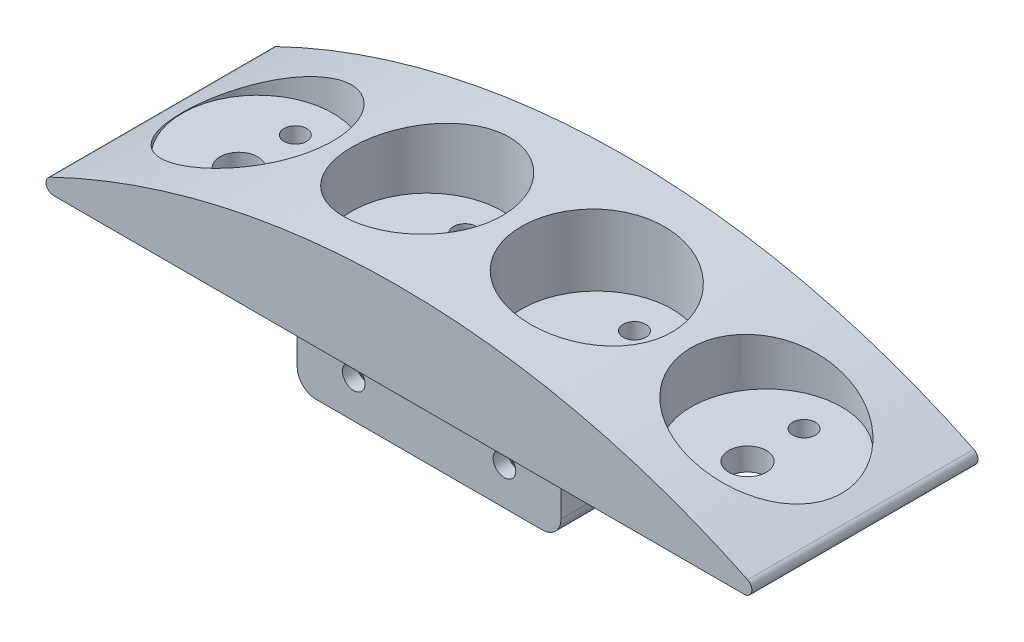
ISO-10303-21;
HEADER;
FILE_DESCRIPTION(('STEP AP214'),'2;1');
FILE_NAME('part.step','',(''),(''),'','','');
FILE_SCHEMA(('AUTOMOTIVE_DESIGN { 1 0 10303 214 1 1 1 1 }'));
ENDSEC;
DATA;
#1=APPLICATION_CONTEXT('core data for automotive mechanical design processes');
#2=APPLICATION_PROTOCOL_DEFINITION('international standard','automotive_design',2000,#1);
#3=PRODUCT_CONTEXT('',#1,'mechanical');
#4=PRODUCT('Part','Part','',(#3));
#5=PRODUCT_RELATED_PRODUCT_CATEGORY('part','',(#4));
#6=PRODUCT_DEFINITION_FORMATION('','',#4);
#7=PRODUCT_DEFINITION_CONTEXT('part definition',#1,'design');
#8=PRODUCT_DEFINITION('design','',#6,#7);
#9=PRODUCT_DEFINITION_SHAPE('','',#8);
#10=(LENGTH_UNIT() NAMED_UNIT(*) SI_UNIT(.MILLI.,.METRE.));
#11=(NAMED_UNIT(*) PLANE_ANGLE_UNIT() SI_UNIT($,.RADIAN.));
#12=(NAMED_UNIT(*) SI_UNIT($,.STERADIAN.) SOLID_ANGLE_UNIT());
#13=UNCERTAINTY_MEASURE_WITH_UNIT(LENGTH_MEASURE(1.E-05),#10,'distance_accuracy_value','');
#14=(GEOMETRIC_REPRESENTATION_CONTEXT(3) GLOBAL_UNCERTAINTY_ASSIGNED_CONTEXT((#13)) GLOBAL_UNIT_ASSIGNED_CONTEXT((#10,
#11,#12)) REPRESENTATION_CONTEXT('',''));
#15=CARTESIAN_POINT('',(0.,0.,0.));
#16=DIRECTION('',(0.,0.,1.));
#17=DIRECTION('',(1.,0.,0.));
#18=AXIS2_PLACEMENT_3D('',#15,#16,#17);
#19=CARTESIAN_POINT('',(135.,-20.,42.));
#20=DIRECTION('',(0.,0.,1.));
#21=DIRECTION('',(1.,0.,0.));
#22=AXIS2_PLACEMENT_3D('',#19,#20,#21);
#23=PLANE('',#22);
#24=CARTESIAN_POINT('',(120.,-10.,42.));
#25=DIRECTION('',(0.,0.,-1.));
#26=DIRECTION('',(-1.,0.,0.));
#27=AXIS2_PLACEMENT_3D('',#24,#25,#26);
#28=CIRCLE('',#27,4.);
#29=CARTESIAN_POINT('',(116.,-10.,42.));
#30=VERTEX_POINT('',#29);
#31=EDGE_CURVE('E1126',#30,#30,#28,.T.);
#32=ORIENTED_EDGE('',*,*,#31,.F.);
#33=EDGE_LOOP('',(#32));
#34=FACE_BOUND('',#33,.T.);
#35=DIRECTION('',(0.,1.,0.));
#36=VECTOR('',#35,1.);
#37=CARTESIAN_POINT('',(135.,-20.,42.));
#38=LINE('',#37,#36);
#39=CARTESIAN_POINT('',(135.,-15.,42.));
#40=VERTEX_POINT('',#39);
#41=CARTESIAN_POINT('',(135.,-5.,42.));
#42=VERTEX_POINT('',#41);
#43=EDGE_CURVE('E508',#40,#42,#38,.T.);
#44=ORIENTED_EDGE('',*,*,#43,.F.);
#45=CARTESIAN_POINT('',(130.,-15.,42.));
#46=DIRECTION('',(0.,0.,1.));
#47=DIRECTION('',(1.,0.,0.));
#48=AXIS2_PLACEMENT_3D('',#45,#46,#47);
#49=CIRCLE('',#48,5.);
#50=CARTESIAN_POINT('',(130.,-20.,42.));
#51=VERTEX_POINT('',#50);
#52=EDGE_CURVE('E387',#40,#51,#49,.F.);
#53=ORIENTED_EDGE('',*,*,#52,.T.);
#54=DIRECTION('',(1.,0.,0.));
#55=VECTOR('',#54,1.);
#56=CARTESIAN_POINT('',(135.,-20.,42.));
#57=LINE('',#56,#55);
#58=CARTESIAN_POINT('',(70.,-20.,42.));
#59=VERTEX_POINT('',#58);
#60=EDGE_CURVE('E501',#59,#51,#57,.T.);
#61=ORIENTED_EDGE('',*,*,#60,.F.);
#62=CARTESIAN_POINT('',(70.,-15.,42.));
#63=DIRECTION('',(0.,0.,1.));
#64=DIRECTION('',(1.,0.,0.));
#65=AXIS2_PLACEMENT_3D('',#62,#63,#64);
#66=CIRCLE('',#65,5.);
#67=CARTESIAN_POINT('',(65.,-15.,42.));
#68=VERTEX_POINT('',#67);
#69=EDGE_CURVE('E389',#59,#68,#66,.F.);
#70=ORIENTED_EDGE('',*,*,#69,.T.);
#71=DIRECTION('',(0.,1.,0.));
#72=VECTOR('',#71,1.);
#73=CARTESIAN_POINT('',(65.,-20.,42.));
#74=LINE('',#73,#72);
#75=CARTESIAN_POINT('',(65.,-5.,42.));
#76=VERTEX_POINT('',#75);
#77=EDGE_CURVE('E510',#68,#76,#74,.T.);
#78=ORIENTED_EDGE('',*,*,#77,.T.);
#79=CARTESIAN_POINT('',(60.,-5.,42.));
#80=DIRECTION('',(0.,0.,1.));
#81=DIRECTION('',(1.,0.,0.));
#82=AXIS2_PLACEMENT_3D('',#79,#80,#81);
#83=CIRCLE('',#82,5.);
#84=CARTESIAN_POINT('',(60.,0.,42.));
#85=VERTEX_POINT('',#84);
#86=EDGE_CURVE('E365',#76,#85,#83,.T.);
#87=ORIENTED_EDGE('',*,*,#86,.T.);
#88=DIRECTION('',(1.,0.,0.));
#89=VECTOR('',#88,1.);
#90=CARTESIAN_POINT('',(135.,0.,42.));
#91=LINE('',#90,#89);
#92=CARTESIAN_POINT('',(140.,0.,42.));
#93=VERTEX_POINT('',#92);
#94=EDGE_CURVE('E345',#85,#93,#91,.T.);
#95=ORIENTED_EDGE('',*,*,#94,.T.);
#96=CARTESIAN_POINT('',(140.,-5.,42.));
#97=DIRECTION('',(0.,0.,1.));
#98=DIRECTION('',(1.,0.,0.));
#99=AXIS2_PLACEMENT_3D('',#96,#97,#98);
#100=CIRCLE('',#99,5.);
#101=EDGE_CURVE('E368',#93,#42,#100,.T.);
#102=ORIENTED_EDGE('',*,*,#101,.T.);
#103=EDGE_LOOP('',(#44,#53,#61,#70,#78,#87,#95,#102));
#104=FACE_BOUND('',#103,.T.);
#105=CARTESIAN_POINT('',(80.,-10.,42.));
#106=DIRECTION('',(0.,0.,-1.));
#107=DIRECTION('',(-1.,0.,0.));
#108=AXIS2_PLACEMENT_3D('',#105,#106,#107);
#109=CIRCLE('',#108,4.);
#110=CARTESIAN_POINT('',(76.,-10.,42.));
#111=VERTEX_POINT('',#110);
#112=EDGE_CURVE('E470',#111,#111,#109,.T.);
#113=ORIENTED_EDGE('',*,*,#112,.F.);
#114=EDGE_LOOP('',(#113));
#115=FACE_BOUND('',#114,.T.);
#116=ADVANCED_FACE('F37',(#34,#104,#115),#23,.F.);
#117=CARTESIAN_POINT('',(0.,0.,0.));
#118=DIRECTION('',(0.,-1.,0.));
#119=DIRECTION('',(0.,0.,-1.));
#120=AXIS2_PLACEMENT_3D('',#117,#118,#119);
#121=PLANE('',#120);
#122=CARTESIAN_POINT('',(167.5,0.,20.));
#123=DIRECTION('',(0.,-1.,0.));
#124=DIRECTION('',(0.,0.,-1.));
#125=AXIS2_PLACEMENT_3D('',#122,#123,#124);
#126=CIRCLE('',#125,2.99999999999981);
#127=CARTESIAN_POINT('',(167.5,0.,17.0000000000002));
#128=VERTEX_POINT('',#127);
#129=EDGE_CURVE('E308',#128,#128,#126,.T.);
#130=ORIENTED_EDGE('',*,*,#129,.F.);
#131=EDGE_LOOP('',(#130));
#132=FACE_BOUND('',#131,.T.);
#133=CARTESIAN_POINT('',(32.5000000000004,0.,20.000000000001));
#134=DIRECTION('',(0.,-1.,0.));
#135=DIRECTION('',(0.,0.,-1.));
#136=AXIS2_PLACEMENT_3D('',#133,#134,#135);
#137=CIRCLE('',#136,2.99999999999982);
#138=CARTESIAN_POINT('',(32.5000000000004,0.,17.0000000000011));
#139=VERTEX_POINT('',#138);
#140=EDGE_CURVE('E312',#139,#139,#137,.T.);
#141=ORIENTED_EDGE('',*,*,#140,.F.);
#142=EDGE_LOOP('',(#141));
#143=FACE_BOUND('',#142,.T.);
#144=CARTESIAN_POINT('',(122.5,0.,20.));
#145=DIRECTION('',(0.,-1.,0.));
#146=DIRECTION('',(0.,0.,-1.));
#147=AXIS2_PLACEMENT_3D('',#144,#145,#146);
#148=CIRCLE('',#147,2.99999999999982);
#149=CARTESIAN_POINT('',(122.5,0.,17.0000000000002));
#150=VERTEX_POINT('',#149);
#151=EDGE_CURVE('E316',#150,#150,#148,.T.);
#152=ORIENTED_EDGE('',*,*,#151,.F.);
#153=EDGE_LOOP('',(#152));
#154=FACE_BOUND('',#153,.T.);
#155=CARTESIAN_POINT('',(77.5000000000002,0.,20.000000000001));
#156=DIRECTION('',(0.,-1.,0.));
#157=DIRECTION('',(0.,0.,-1.));
#158=AXIS2_PLACEMENT_3D('',#155,#156,#157);
#159=CIRCLE('',#158,2.99999999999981);
#160=CARTESIAN_POINT('',(77.5000000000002,0.,17.0000000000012));
#161=VERTEX_POINT('',#160);
#162=EDGE_CURVE('E320',#161,#161,#159,.T.);
#163=ORIENTED_EDGE('',*,*,#162,.F.);
#164=EDGE_LOOP('',(#163));
#165=FACE_BOUND('',#164,.T.);
#166=CARTESIAN_POINT('',(167.5,0.,34.9999999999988));
#167=DIRECTION('',(0.,-1.,0.));
#168=DIRECTION('',(0.,0.,-1.));
#169=AXIS2_PLACEMENT_3D('',#166,#167,#168);
#170=CIRCLE('',#169,4.99999999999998);
#171=CARTESIAN_POINT('',(167.5,0.,29.9999999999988));
#172=VERTEX_POINT('',#171);
#173=EDGE_CURVE('E324',#172,#172,#170,.T.);
#174=ORIENTED_EDGE('',*,*,#173,.F.);
#175=EDGE_LOOP('',(#174));
#176=FACE_BOUND('',#175,.T.);
#177=CARTESIAN_POINT('',(32.5000000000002,0.,34.9999999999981));
#178=DIRECTION('',(0.,-1.,0.));
#179=DIRECTION('',(0.,0.,-1.));
#180=AXIS2_PLACEMENT_3D('',#177,#178,#179);
#181=CIRCLE('',#180,4.99999999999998);
#182=CARTESIAN_POINT('',(32.5000000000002,0.,29.9999999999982));
#183=VERTEX_POINT('',#182);
#184=EDGE_CURVE('E328',#183,#183,#181,.T.);
#185=ORIENTED_EDGE('',*,*,#184,.F.);
#186=EDGE_LOOP('',(#185));
#187=FACE_BOUND('',#186,.T.);
#188=CARTESIAN_POINT('',(77.5000000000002,0.,34.9999999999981));
#189=DIRECTION('',(0.,-1.,0.));
#190=DIRECTION('',(0.,0.,-1.));
#191=AXIS2_PLACEMENT_3D('',#188,#189,#190);
#192=CIRCLE('',#191,4.99999999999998);
#193=CARTESIAN_POINT('',(77.5000000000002,0.,29.9999999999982));
#194=VERTEX_POINT('',#193);
#195=EDGE_CURVE('E332',#194,#194,#192,.T.);
#196=ORIENTED_EDGE('',*,*,#195,.F.);
#197=EDGE_LOOP('',(#196));
#198=FACE_BOUND('',#197,.T.);
#199=CARTESIAN_POINT('',(122.5,0.,34.9999999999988));
#200=DIRECTION('',(0.,-1.,0.));
#201=DIRECTION('',(0.,0.,-1.));
#202=AXIS2_PLACEMENT_3D('',#199,#200,#201);
#203=CIRCLE('',#202,4.99999999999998);
#204=CARTESIAN_POINT('',(122.5,0.,29.9999999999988));
#205=VERTEX_POINT('',#204);
#206=EDGE_CURVE('E336',#205,#205,#203,.T.);
#207=ORIENTED_EDGE('',*,*,#206,.F.);
#208=EDGE_LOOP('',(#207));
#209=FACE_BOUND('',#208,.T.);
#210=DIRECTION('',(1.,0.,0.));
#211=VECTOR('',#210,1.);
#212=CARTESIAN_POINT('',(200.,0.,52.));
#213=LINE('',#212,#211);
#214=CARTESIAN_POINT('',(60.,0.,52.));
#215=VERTEX_POINT('',#214);
#216=CARTESIAN_POINT('',(140.,0.,52.));
#217=VERTEX_POINT('',#216);
#218=EDGE_CURVE('E198',#215,#217,#213,.T.);
#219=ORIENTED_EDGE('',*,*,#218,.T.);
#220=DIRECTION('',(0.,0.,1.));
#221=VECTOR('',#220,1.);
#222=CARTESIAN_POINT('',(140.,0.,0.));
#223=LINE('',#222,#221);
#224=EDGE_CURVE('E415',#217,#93,#223,.F.);
#225=ORIENTED_EDGE('',*,*,#224,.T.);
#226=ORIENTED_EDGE('',*,*,#94,.F.);
#227=DIRECTION('',(0.,0.,-1.));
#228=VECTOR('',#227,1.);
#229=CARTESIAN_POINT('',(60.,0.,0.));
#230=LINE('',#229,#228);
#231=EDGE_CURVE('E417',#85,#215,#230,.F.);
#232=ORIENTED_EDGE('',*,*,#231,.T.);
#233=EDGE_LOOP('',(#219,#225,#226,#232));
#234=FACE_BOUND('',#233,.T.);
#235=DIRECTION('',(1.,0.,0.));
#236=VECTOR('',#235,1.);
#237=CARTESIAN_POINT('',(200.,0.,60.));
#238=LINE('',#237,#236);
#239=CARTESIAN_POINT('',(8.34848610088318,0.,60.));
#240=VERTEX_POINT('',#239);
#241=CARTESIAN_POINT('',(191.651513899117,0.,60.));
#242=VERTEX_POINT('',#241);
#243=EDGE_CURVE('E342',#240,#242,#238,.T.);
#244=ORIENTED_EDGE('',*,*,#243,.F.);
#245=DIRECTION('',(0.,0.,1.));
#246=VECTOR('',#245,1.);
#247=CARTESIAN_POINT('',(8.34848610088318,0.,0.));
#248=LINE('',#247,#246);
#249=CARTESIAN_POINT('',(8.34848610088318,0.,0.));
#250=VERTEX_POINT('',#249);
#251=EDGE_CURVE('E59',#240,#250,#248,.F.);
#252=ORIENTED_EDGE('',*,*,#251,.T.);
#253=DIRECTION('',(1.,0.,0.));
#254=VECTOR('',#253,1.);
#255=CARTESIAN_POINT('',(0.,0.,0.));
#256=LINE('',#255,#254);
#257=CARTESIAN_POINT('',(60.,0.,0.));
#258=VERTEX_POINT('',#257);
#259=EDGE_CURVE('E226',#250,#258,#256,.T.);
#260=ORIENTED_EDGE('',*,*,#259,.T.);
#261=DIRECTION('',(0.,0.,-1.));
#262=VECTOR('',#261,1.);
#263=CARTESIAN_POINT('',(60.,0.,0.));
#264=LINE('',#263,#262);
#265=CARTESIAN_POINT('',(60.,0.,11.5));
#266=VERTEX_POINT('',#265);
#267=EDGE_CURVE('E410',#258,#266,#264,.F.);
#268=ORIENTED_EDGE('',*,*,#267,.T.);
#269=DIRECTION('',(-1.,0.,0.));
#270=VECTOR('',#269,1.);
#271=CARTESIAN_POINT('',(65.,0.,11.5));
#272=LINE('',#271,#270);
#273=CARTESIAN_POINT('',(140.,0.,11.5));
#274=VERTEX_POINT('',#273);
#275=EDGE_CURVE('E203',#274,#266,#272,.T.);
#276=ORIENTED_EDGE('',*,*,#275,.F.);
#277=DIRECTION('',(0.,0.,1.));
#278=VECTOR('',#277,1.);
#279=CARTESIAN_POINT('',(140.,0.,0.));
#280=LINE('',#279,#278);
#281=CARTESIAN_POINT('',(140.,0.,0.));
#282=VERTEX_POINT('',#281);
#283=EDGE_CURVE('E413',#274,#282,#280,.F.);
#284=ORIENTED_EDGE('',*,*,#283,.T.);
#285=CARTESIAN_POINT('',(191.651513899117,0.,0.));
#286=VERTEX_POINT('',#285);
#287=EDGE_CURVE('E225',#282,#286,#256,.T.);
#288=ORIENTED_EDGE('',*,*,#287,.T.);
#289=DIRECTION('',(0.,0.,1.));
#290=VECTOR('',#289,1.);
#291=CARTESIAN_POINT('',(191.651513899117,0.,0.));
#292=LINE('',#291,#290);
#293=EDGE_CURVE('E344',#286,#242,#292,.T.);
#294=ORIENTED_EDGE('',*,*,#293,.T.);
#295=EDGE_LOOP('',(#244,#252,#260,#268,#276,#284,#288,#294));
#296=FACE_BOUND('',#295,.T.);
#297=ADVANCED_FACE('F274',(#132,#143,#154,#165,#176,#187,#198,#209,#234,#296),#121,.T.);
#298=CARTESIAN_POINT('',(100.,-187.5,0.));
#299=DIRECTION('',(0.,0.,1.));
#300=DIRECTION('',(1.,0.,0.));
#301=AXIS2_PLACEMENT_3D('',#298,#299,#300);
#302=CYLINDRICAL_SURFACE('',#301,212.5);
#303=CARTESIAN_POINT('',(77.5,23.8054660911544,50.));
#304=CARTESIAN_POINT('',(78.0593799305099,23.8650310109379,50.0000060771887));
#305=CARTESIAN_POINT('',(78.6189060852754,23.9223574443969,49.976524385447));
#306=CARTESIAN_POINT('',(79.7346603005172,24.0322199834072,49.8826476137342));
#307=CARTESIAN_POINT('',(80.2908876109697,24.0847550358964,49.8122422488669));
#308=CARTESIAN_POINT('',(81.3964069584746,24.1848240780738,49.6247973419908));
#309=CARTESIAN_POINT('',(81.9456921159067,24.2323534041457,49.5077147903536));
#310=CARTESIAN_POINT('',(83.0328400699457,24.3222437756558,49.2276552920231));
#311=CARTESIAN_POINT('',(83.5707035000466,24.3646051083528,49.0646808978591));
#312=CARTESIAN_POINT('',(84.6310560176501,24.4441629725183,48.6939412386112));
#313=CARTESIAN_POINT('',(85.1535477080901,24.4813603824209,48.4861836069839));
#314=CARTESIAN_POINT('',(86.1794702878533,24.5507187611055,48.0272731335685));
#315=CARTESIAN_POINT('',(86.6829009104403,24.5828796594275,47.7761196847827));
#316=CARTESIAN_POINT('',(87.6669310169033,24.6423775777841,47.2322222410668));
#317=CARTESIAN_POINT('',(88.1475352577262,24.6697156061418,46.9394869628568));
#318=CARTESIAN_POINT('',(89.0825310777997,24.7198814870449,46.3144474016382));
#319=CARTESIAN_POINT('',(89.536922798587,24.7427093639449,45.9821433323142));
#320=CARTESIAN_POINT('',(90.4148056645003,24.7841647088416,45.2814337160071));
#321=CARTESIAN_POINT('',(90.8383900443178,24.8028052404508,44.9131457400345));
#322=CARTESIAN_POINT('',(91.653189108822,24.8364006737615,44.1421993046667));
#323=CARTESIAN_POINT('',(92.0444038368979,24.8513555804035,43.739540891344));
#324=CARTESIAN_POINT('',(92.7916675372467,24.8780350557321,42.9026970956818));
#325=CARTESIAN_POINT('',(93.1477154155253,24.8897595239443,42.4685107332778));
#326=CARTESIAN_POINT('',(93.822083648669,24.9104451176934,41.5717044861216));
#327=CARTESIAN_POINT('',(94.140403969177,24.9194062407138,41.1090845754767));
#328=CARTESIAN_POINT('',(94.7371361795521,24.9350286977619,40.1585498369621));
#329=CARTESIAN_POINT('',(95.0155357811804,24.9416893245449,39.6706272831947));
#330=CARTESIAN_POINT('',(95.5303263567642,24.9531438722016,38.6730823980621));
#331=CARTESIAN_POINT('',(95.7667173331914,24.9579377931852,38.1634600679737));
#332=CARTESIAN_POINT('',(96.1958100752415,24.9660542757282,37.1261301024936));
#333=CARTESIAN_POINT('',(96.3885117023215,24.9693768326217,36.5984224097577));
#334=CARTESIAN_POINT('',(96.7288562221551,24.9748893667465,35.5286655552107));
#335=CARTESIAN_POINT('',(96.8764990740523,24.9770793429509,34.9866163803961));
#336=CARTESIAN_POINT('',(97.1258364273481,24.9805985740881,33.8913240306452));
#337=CARTESIAN_POINT('',(97.2274723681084,24.9819267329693,33.3380675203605));
#338=CARTESIAN_POINT('',(97.3837978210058,24.9839090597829,32.224959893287));
#339=CARTESIAN_POINT('',(97.4384872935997,24.9845632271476,31.6651087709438));
#340=CARTESIAN_POINT('',(97.5005310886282,24.9853021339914,30.5427885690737));
#341=CARTESIAN_POINT('',(97.5078853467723,24.9853868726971,29.9803194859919));
#342=CARTESIAN_POINT('',(97.4752062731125,24.985001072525,28.8567598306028));
#343=CARTESIAN_POINT('',(97.4351729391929,24.9845305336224,28.2956692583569));
#344=CARTESIAN_POINT('',(97.3079787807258,24.9829571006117,27.1786383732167));
#345=CARTESIAN_POINT('',(97.2207999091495,24.9818539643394,26.6227001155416));
#346=CARTESIAN_POINT('',(96.999923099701,24.9788500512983,25.5201447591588));
#347=CARTESIAN_POINT('',(96.866225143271,24.9769492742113,24.9735276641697));
#348=CARTESIAN_POINT('',(96.5532613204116,24.9721027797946,23.8935005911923));
#349=CARTESIAN_POINT('',(96.3739953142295,24.9691570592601,23.3600906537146));
#350=CARTESIAN_POINT('',(95.971172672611,24.9619003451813,22.3102747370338));
#351=CARTESIAN_POINT('',(95.7476160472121,24.9575893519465,21.7938687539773));
#352=CARTESIAN_POINT('',(95.2578379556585,24.9472213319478,20.7818010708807));
#353=CARTESIAN_POINT('',(94.9916219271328,24.9411645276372,20.2861367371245));
#354=CARTESIAN_POINT('',(94.4184063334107,24.9268767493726,19.3190120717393));
#355=CARTESIAN_POINT('',(94.1114067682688,24.9186457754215,18.847551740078));
#356=CARTESIAN_POINT('',(93.4588241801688,24.8995516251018,17.9321972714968));
#357=CARTESIAN_POINT('',(93.1132414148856,24.8886884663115,17.4883029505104));
#358=CARTESIAN_POINT('',(92.3859714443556,24.8638596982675,16.6312408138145));
#359=CARTESIAN_POINT('',(92.0042842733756,24.8498940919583,16.2180729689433));
#360=CARTESIAN_POINT('',(91.2079292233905,24.818412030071,15.4257811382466));
#361=CARTESIAN_POINT('',(90.7932928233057,24.8008989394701,15.046625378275));
#362=CARTESIAN_POINT('',(89.9337131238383,24.7618781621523,14.3246109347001));
#363=CARTESIAN_POINT('',(89.4887698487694,24.7403704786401,13.9817522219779));
#364=CARTESIAN_POINT('',(88.5717965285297,24.692970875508,13.3347614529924));
#365=CARTESIAN_POINT('',(88.0997669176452,24.6670790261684,13.0306287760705));
#366=CARTESIAN_POINT('',(87.1320281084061,24.6105848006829,12.463220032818));
#367=CARTESIAN_POINT('',(86.6363189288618,24.579982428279,12.1999439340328));
#368=CARTESIAN_POINT('',(85.6254044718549,24.5138609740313,11.7163629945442));
#369=CARTESIAN_POINT('',(85.1102229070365,24.4783477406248,11.4960077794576));
#370=CARTESIAN_POINT('',(84.0635269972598,24.4022277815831,11.0993826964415));
#371=CARTESIAN_POINT('',(83.5320126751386,24.3616210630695,10.9231127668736));
#372=CARTESIAN_POINT('',(82.4564699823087,24.2752714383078,10.6158257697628));
#373=CARTESIAN_POINT('',(81.9124416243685,24.2295285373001,10.4848086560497));
#374=CARTESIAN_POINT('',(80.8157581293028,24.132979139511,10.2688548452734));
#375=CARTESIAN_POINT('',(80.2631029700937,24.0821726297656,10.1839182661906));
#376=CARTESIAN_POINT('',(79.1518033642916,23.9755659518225,10.0604707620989));
#377=CARTESIAN_POINT('',(78.5931480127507,23.919754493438,10.0220677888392));
#378=CARTESIAN_POINT('',(77.4750621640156,23.8035567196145,9.99219816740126));
#379=CARTESIAN_POINT('',(76.9156316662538,23.7431704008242,10.0007315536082));
#380=CARTESIAN_POINT('',(75.7998910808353,23.6182603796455,10.0645571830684));
#381=CARTESIAN_POINT('',(75.2435811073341,23.5537365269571,10.1198511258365));
#382=CARTESIAN_POINT('',(74.1379548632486,23.4211099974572,10.2767037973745));
#383=CARTESIAN_POINT('',(73.5886386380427,23.3530072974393,10.3782628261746));
#384=CARTESIAN_POINT('',(72.4963167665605,23.2133196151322,10.6278658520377));
#385=CARTESIAN_POINT('',(71.9533995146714,23.1417107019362,10.7762833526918));
#386=CARTESIAN_POINT('',(70.8822592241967,22.9963166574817,11.1182209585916));
#387=CARTESIAN_POINT('',(70.3540362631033,22.9225315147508,11.311741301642));
#388=CARTESIAN_POINT('',(69.3158858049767,22.7736554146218,11.7425050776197));
#389=CARTESIAN_POINT('',(68.8059593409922,22.6985643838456,11.9797509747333));
#390=CARTESIAN_POINT('',(67.8079269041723,22.5480305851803,12.4963018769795));
#391=CARTESIAN_POINT('',(67.3198210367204,22.4725878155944,12.7756070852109));
#392=CARTESIAN_POINT('',(66.3647838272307,22.3217289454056,13.3768826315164));
#393=CARTESIAN_POINT('',(65.8980647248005,22.2463183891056,13.6991915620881));
#394=CARTESIAN_POINT('',(64.9934983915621,22.0972447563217,14.3824239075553));
#395=CARTESIAN_POINT('',(64.5556513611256,22.0235816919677,14.743347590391));
#396=CARTESIAN_POINT('',(63.7119346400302,21.8791048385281,15.5013496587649));
#397=CARTESIAN_POINT('',(63.3060654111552,21.8082910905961,15.8984285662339));
#398=CARTESIAN_POINT('',(62.5292425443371,21.6706193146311,16.7260214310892));
#399=CARTESIAN_POINT('',(62.1582887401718,21.6037612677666,17.1565352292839));
#400=CARTESIAN_POINT('',(61.4548045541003,21.4752270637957,18.0470519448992));
#401=CARTESIAN_POINT('',(61.122191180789,21.41353979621,18.5069876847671));
#402=CARTESIAN_POINT('',(60.4969399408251,21.2962151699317,19.4540106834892));
#403=CARTESIAN_POINT('',(60.2043021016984,21.2405778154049,19.941097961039));
#404=CARTESIAN_POINT('',(59.6612754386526,21.1363194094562,20.9389554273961));
#405=CARTESIAN_POINT('',(59.4108834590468,21.087697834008,21.4497238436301));
#406=CARTESIAN_POINT('',(58.9543007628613,20.9983326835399,22.4913137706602));
#407=CARTESIAN_POINT('',(58.7481094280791,20.9575889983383,23.02213500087));
#408=CARTESIAN_POINT('',(58.3844310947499,20.8852880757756,24.0916091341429));
#409=CARTESIAN_POINT('',(58.2262393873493,20.8535983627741,24.6300135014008));
#410=CARTESIAN_POINT('',(57.9555757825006,20.7991490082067,25.7186380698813));
#411=CARTESIAN_POINT('',(57.8431034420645,20.7763892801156,26.2688581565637));
#412=CARTESIAN_POINT('',(57.6648006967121,20.7402199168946,27.3770593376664));
#413=CARTESIAN_POINT('',(57.5989661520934,20.7268094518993,27.9350397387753));
#414=CARTESIAN_POINT('',(57.5144649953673,20.7095847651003,29.0547069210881));
#415=CARTESIAN_POINT('',(57.4957979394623,20.7057704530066,29.6163936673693));
#416=CARTESIAN_POINT('',(57.5057051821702,20.7077926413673,30.7304854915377));
#417=CARTESIAN_POINT('',(57.5335408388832,20.7134782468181,31.2828975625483));
#418=CARTESIAN_POINT('',(57.634830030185,20.7341111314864,32.3833431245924));
#419=CARTESIAN_POINT('',(57.7082830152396,20.7490582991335,32.9313766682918));
#420=CARTESIAN_POINT('',(57.9002206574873,20.7879452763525,34.0191641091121));
#421=CARTESIAN_POINT('',(58.0187046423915,20.811884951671,34.5589181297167));
#422=CARTESIAN_POINT('',(58.2997735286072,20.8683316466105,35.6263589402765));
#423=CARTESIAN_POINT('',(58.4623586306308,20.9008387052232,36.1540456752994));
#424=CARTESIAN_POINT('',(58.8303289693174,20.973843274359,37.1935605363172));
#425=CARTESIAN_POINT('',(59.0357039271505,21.0143388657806,37.7053924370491));
#426=CARTESIAN_POINT('',(59.4877235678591,21.1026328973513,38.7098339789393));
#427=CARTESIAN_POINT('',(59.7343681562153,21.1504313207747,39.2024436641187));
#428=CARTESIAN_POINT('',(60.2671119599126,21.2525356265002,40.1651479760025));
#429=CARTESIAN_POINT('',(60.5532121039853,21.3068416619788,40.6352420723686));
#430=CARTESIAN_POINT('',(61.1628017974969,21.4210811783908,41.5498040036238));
#431=CARTESIAN_POINT('',(61.4862917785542,21.481014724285,41.9942715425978));
#432=CARTESIAN_POINT('',(62.1735684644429,21.6065156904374,42.8612250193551));
#433=CARTESIAN_POINT('',(62.5378924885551,21.6721548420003,43.2832746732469));
#434=CARTESIAN_POINT('',(63.3001491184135,21.8072400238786,44.0951873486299));
#435=CARTESIAN_POINT('',(63.6980821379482,21.8766861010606,44.4850499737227));
#436=CARTESIAN_POINT('',(64.5249161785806,22.0183628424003,45.2301343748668));
#437=CARTESIAN_POINT('',(64.9538265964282,22.090594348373,45.5853455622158));
#438=CARTESIAN_POINT('',(65.8395671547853,22.2367785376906,46.2586525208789));
#439=CARTESIAN_POINT('',(66.2963971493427,22.3107312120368,46.5767484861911));
#440=CARTESIAN_POINT('',(67.2425491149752,22.460549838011,47.1785955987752));
#441=CARTESIAN_POINT('',(67.7322793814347,22.5364273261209,47.4617022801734));
#442=CARTESIAN_POINT('',(68.7340190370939,22.6878803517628,47.9854683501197));
#443=CARTESIAN_POINT('',(69.2460299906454,22.7634558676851,48.2261247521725));
#444=CARTESIAN_POINT('',(70.2882563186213,22.9132578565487,48.6630565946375));
#445=CARTESIAN_POINT('',(70.8184533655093,22.9874855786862,48.8593752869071));
#446=CARTESIAN_POINT('',(71.8936579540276,23.1337532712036,49.2064596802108));
#447=CARTESIAN_POINT('',(72.4386619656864,23.2057937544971,49.357236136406));
#448=CARTESIAN_POINT('',(73.7272613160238,23.3709221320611,49.6555292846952));
#449=CARTESIAN_POINT('',(74.4753751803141,23.4628382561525,49.7845078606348));
#450=CARTESIAN_POINT('',(75.9822362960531,23.6396987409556,49.9567390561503));
#451=CARTESIAN_POINT('',(76.7409835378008,23.7246431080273,49.9999917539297));
#452=CARTESIAN_POINT('',(77.5,23.8054660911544,50.));
#453=B_SPLINE_CURVE_WITH_KNOTS('',3,(#303,#304,#305,#306,#307,#308,#309,#310,#311,#312,#313,
#314,#315,#316,#317,#318,#319,#320,#321,#322,#323,#324,#325,#326,#327,#328,#329,#330,#331,#332,
#333,#334,#335,#336,#337,#338,#339,#340,#341,#342,#343,#344,#345,#346,#347,#348,#349,#350,#351,
#352,#353,#354,#355,#356,#357,#358,#359,#360,#361,#362,#363,#364,#365,#366,#367,#368,#369,#370,
#371,#372,#373,#374,#375,#376,#377,#378,#379,#380,#381,#382,#383,#384,#385,#386,#387,#388,#389,
#390,#391,#392,#393,#394,#395,#396,#397,#398,#399,#400,#401,#402,#403,#404,#405,#406,#407,#408,
#409,#410,#411,#412,#413,#414,#415,#416,#417,#418,#419,#420,#421,#422,#423,#424,#425,#426,#427,
#428,#429,#430,#431,#432,#433,#434,#435,#436,#437,#438,#439,#440,#441,#442,#443,#444,#445,#446,
#447,#448,#449,#450,#451,#452),.UNSPECIFIED.,.T.,.F.,(4,2,2,2,2,2,2,2,2,2,2,2,2,2,2,2,2,2,2,2,2,
2,2,2,2,2,2,2,2,2,2,2,2,2,2,2,2,2,2,2,2,2,2,2,2,2,2,2,2,2,2,2,2,2,2,2,2,2,2,2,2,2,2,2,2,2,2,2,2,
2,2,2,2,2,4),(0.,1.68697218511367,3.37431424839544,5.06321468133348,6.75202119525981,
8.44054007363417,10.1290825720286,11.817271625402,13.5054515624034,15.1882892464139,
16.8711246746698,18.5540124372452,20.2369017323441,21.9203079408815,23.6037140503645,
25.2871254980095,26.9705384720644,28.6560882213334,30.3416393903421,32.0271928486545,
33.7127463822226,35.3989455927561,37.0851454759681,38.7713505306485,40.4575552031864,
42.143545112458,43.8295350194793,45.5155136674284,47.2014907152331,48.8858759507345,
50.5702598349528,52.2546167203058,53.9389722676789,55.6213388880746,57.3037031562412,
58.9860657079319,60.6684325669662,62.3546948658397,64.0409584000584,65.7272832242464,
67.4136189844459,69.1137509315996,70.8138918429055,72.5141285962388,74.2143735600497,
75.9288966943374,77.643431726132,79.3579915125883,81.0725431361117,82.7833108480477,
84.4940797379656,86.2047207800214,87.9153378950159,89.5994675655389,91.2835809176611,
92.9675447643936,94.6514927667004,96.3089466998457,97.9663806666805,99.6237898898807,
101.281206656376,102.938225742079,104.595241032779,106.252295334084,107.909368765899,
109.591605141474,111.273862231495,112.95663178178,114.639392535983,116.349587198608,
118.059902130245,119.76854135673,121.476776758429,123.765812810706,126.054846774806),.UNSPECIFIED.);
#454=CARTESIAN_POINT('',(77.5,23.8054660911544,50.));
#455=VERTEX_POINT('',#454);
#456=EDGE_CURVE('E433',#455,#455,#453,.T.);
#457=ORIENTED_EDGE('',*,*,#456,.F.);
#458=EDGE_LOOP('',(#457));
#459=FACE_BOUND('',#458,.T.);
#460=CARTESIAN_POINT('',(122.5,23.8054660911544,50.));
#461=CARTESIAN_POINT('',(123.066472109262,23.7451483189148,50.0000012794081));
#462=CARTESIAN_POINT('',(123.632658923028,23.6825495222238,49.9759149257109));
#463=CARTESIAN_POINT('',(124.478464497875,23.5856117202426,49.9039147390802));
#464=CARTESIAN_POINT('',(124.75987008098,23.5527864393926,49.8739277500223));
#465=CARTESIAN_POINT('',(125.321120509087,23.4861861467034,49.8020540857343));
#466=CARTESIAN_POINT('',(125.600964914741,23.4524108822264,49.7601642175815));
#467=CARTESIAN_POINT('',(126.437802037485,23.3497294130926,49.6166806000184));
#468=CARTESIAN_POINT('',(126.991683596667,23.2795151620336,49.4973082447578));
#469=CARTESIAN_POINT('',(128.086995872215,23.1363590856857,49.2121249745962));
#470=CARTESIAN_POINT('',(128.628426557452,23.0634172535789,49.0463139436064));
#471=CARTESIAN_POINT('',(129.428118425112,22.9526273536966,48.7638242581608));
#472=CARTESIAN_POINT('',(129.692551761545,22.9154759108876,48.6640569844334));
#473=CARTESIAN_POINT('',(130.216843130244,22.8408245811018,48.4534583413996));
#474=CARTESIAN_POINT('',(130.476702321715,22.8033247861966,48.3426298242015));
#475=CARTESIAN_POINT('',(131.248894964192,22.6904540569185,47.993771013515));
#476=CARTESIAN_POINT('',(131.753884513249,22.6147060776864,47.7393529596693));
#477=CARTESIAN_POINT('',(132.740344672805,22.4632562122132,47.1887879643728));
#478=CARTESIAN_POINT('',(133.22182063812,22.3875543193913,46.8926505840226));
#479=CARTESIAN_POINT('',(134.158119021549,22.2372110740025,46.2606041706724));
#480=CARTESIAN_POINT('',(134.612941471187,22.1625697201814,45.9246951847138));
#481=CARTESIAN_POINT('',(135.494554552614,22.0151241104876,45.2139247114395));
#482=CARTESIAN_POINT('',(135.921220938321,21.9423287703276,44.8389072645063));
#483=CARTESIAN_POINT('',(136.74140055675,21.8000066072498,44.053641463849));
#484=CARTESIAN_POINT('',(137.134913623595,21.7304798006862,43.6433929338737));
#485=CARTESIAN_POINT('',(137.885926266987,21.5957966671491,42.7904711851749));
#486=CARTESIAN_POINT('',(138.243425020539,21.5306404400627,42.3477972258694));
#487=CARTESIAN_POINT('',(138.919736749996,21.4057739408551,41.4330989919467));
#488=CARTESIAN_POINT('',(139.238550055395,21.3460636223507,40.9610749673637));
#489=CARTESIAN_POINT('',(139.832883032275,21.2335197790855,39.9945320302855));
#490=CARTESIAN_POINT('',(140.108701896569,21.1806392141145,39.5002025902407));
#491=CARTESIAN_POINT('',(140.617699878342,21.0821653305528,38.4893559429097));
#492=CARTESIAN_POINT('',(140.850879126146,21.0365719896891,37.9728388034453));
#493=CARTESIAN_POINT('',(141.272735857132,20.9534900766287,36.9213617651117));
#494=CARTESIAN_POINT('',(141.461417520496,20.9160007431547,36.3864036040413));
#495=CARTESIAN_POINT('',(141.792780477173,20.8498070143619,35.3018954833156));
#496=CARTESIAN_POINT('',(141.935462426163,20.8211024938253,34.7523457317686));
#497=CARTESIAN_POINT('',(142.17155199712,20.7734367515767,33.6525054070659));
#498=CARTESIAN_POINT('',(142.265784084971,20.7543126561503,33.1023987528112));
#499=CARTESIAN_POINT('',(142.407965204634,20.7254061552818,31.9959948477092));
#500=CARTESIAN_POINT('',(142.455914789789,20.7156236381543,31.4396976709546));
#501=CARTESIAN_POINT('',(142.505139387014,20.705580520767,30.3249975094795));
#502=CARTESIAN_POINT('',(142.506417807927,20.7053192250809,29.7665946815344));
#503=CARTESIAN_POINT('',(142.462298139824,20.7143216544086,28.6517146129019));
#504=CARTESIAN_POINT('',(142.416900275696,20.7235853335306,28.0952373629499));
#505=CARTESIAN_POINT('',(142.280599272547,20.7513041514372,26.9947146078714));
#506=CARTESIAN_POINT('',(142.190232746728,20.7696508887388,26.4505998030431));
#507=CARTESIAN_POINT('',(141.964982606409,20.8151540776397,25.3720466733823));
#508=CARTESIAN_POINT('',(141.830099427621,20.8423104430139,24.8376082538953));
#509=CARTESIAN_POINT('',(141.51686274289,20.904955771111,23.7821240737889));
#510=CARTESIAN_POINT('',(141.338508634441,20.940444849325,23.261078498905));
#511=CARTESIAN_POINT('',(140.939691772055,21.0191428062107,22.2359640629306));
#512=CARTESIAN_POINT('',(140.719228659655,21.0623517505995,21.7318953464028));
#513=CARTESIAN_POINT('',(140.236375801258,21.1560444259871,20.7411391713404));
#514=CARTESIAN_POINT('',(139.973739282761,21.2065707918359,20.2545760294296));
#515=CARTESIAN_POINT('',(139.409449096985,21.3138591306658,19.3053565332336));
#516=CARTESIAN_POINT('',(139.107795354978,21.3706211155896,18.8427002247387));
#517=CARTESIAN_POINT('',(138.467618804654,21.4894692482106,17.9443208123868));
#518=CARTESIAN_POINT('',(138.129093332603,21.5515557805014,17.5085996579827));
#519=CARTESIAN_POINT('',(137.417569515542,21.6800806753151,16.6669663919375));
#520=CARTESIAN_POINT('',(137.044570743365,21.7465190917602,16.2610546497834));
#521=CARTESIAN_POINT('',(136.259859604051,21.8839391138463,15.4748459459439));
#522=CARTESIAN_POINT('',(135.847584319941,21.9549798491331,15.0951210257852));
#523=CARTESIAN_POINT('',(134.992882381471,22.0994656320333,14.3717775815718));
#524=CARTESIAN_POINT('',(134.550455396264,22.1729107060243,14.0281594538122));
#525=CARTESIAN_POINT('',(133.638471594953,22.3211538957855,13.3793005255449));
#526=CARTESIAN_POINT('',(133.168913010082,22.3959520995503,13.0740622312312));
#527=CARTESIAN_POINT('',(132.205899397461,22.5458699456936,12.504040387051));
#528=CARTESIAN_POINT('',(131.712444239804,22.6209895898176,12.2392570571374));
#529=CARTESIAN_POINT('',(130.698720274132,22.7715015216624,11.7489199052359));
#530=CARTESIAN_POINT('',(130.178194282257,22.8468855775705,11.5238950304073));
#531=CARTESIAN_POINT('',(129.11971039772,22.9960287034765,11.1187774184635));
#532=CARTESIAN_POINT('',(128.581752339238,23.0697877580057,10.9386851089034));
#533=CARTESIAN_POINT('',(127.492170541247,23.2148134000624,10.6247667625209));
#534=CARTESIAN_POINT('',(126.940546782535,23.2860799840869,10.4909407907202));
#535=CARTESIAN_POINT('',(125.827525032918,23.4253504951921,10.2705951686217));
#536=CARTESIAN_POINT('',(125.266127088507,23.4933544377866,10.1840752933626));
#537=CARTESIAN_POINT('',(124.138359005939,23.6253454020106,10.059157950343));
#538=CARTESIAN_POINT('',(123.571997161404,23.6893380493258,10.0206915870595));
#539=CARTESIAN_POINT('',(122.437565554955,23.8128751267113,9.99205065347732));
#540=CARTESIAN_POINT('',(121.869495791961,23.8724195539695,10.0018761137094));
#541=CARTESIAN_POINT('',(120.735786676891,23.9866466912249,10.0698716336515));
#542=CARTESIAN_POINT('',(120.170147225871,24.0413296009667,10.1280397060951));
#543=CARTESIAN_POINT('',(119.045413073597,24.1455556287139,10.2924168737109));
#544=CARTESIAN_POINT('',(118.486318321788,24.1950987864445,10.398625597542));
#545=CARTESIAN_POINT('',(117.383982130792,24.2884564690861,10.6572013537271));
#546=CARTESIAN_POINT('',(116.840641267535,24.3323202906,10.8091268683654));
#547=CARTESIAN_POINT('',(115.768379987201,24.4148351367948,11.1584705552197));
#548=CARTESIAN_POINT('',(115.239459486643,24.4534861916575,11.3558884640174));
#549=CARTESIAN_POINT('',(114.199919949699,24.5256677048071,11.7948634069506));
#550=CARTESIAN_POINT('',(113.689300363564,24.559198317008,12.036419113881));
#551=CARTESIAN_POINT('',(112.690087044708,24.6213386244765,12.561987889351));
#552=CARTESIAN_POINT('',(112.201493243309,24.6499483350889,12.8460008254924));
#553=CARTESIAN_POINT('',(111.253101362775,24.7023604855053,13.4524336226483));
#554=CARTESIAN_POINT('',(110.793132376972,24.7261938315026,13.7745835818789));
#555=CARTESIAN_POINT('',(109.901784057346,24.7696488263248,14.4565179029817));
#556=CARTESIAN_POINT('',(109.470404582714,24.7892704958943,14.8163020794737));
#557=CARTESIAN_POINT('',(108.639346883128,24.8247152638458,15.5709551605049));
#558=CARTESIAN_POINT('',(108.239668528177,24.8405383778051,15.9658239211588));
#559=CARTESIAN_POINT('',(107.474885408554,24.8688361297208,16.7878433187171));
#560=CARTESIAN_POINT('',(107.109780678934,24.8813107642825,17.2149939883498));
#561=CARTESIAN_POINT('',(106.417061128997,24.9033694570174,18.0981610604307));
#562=CARTESIAN_POINT('',(106.089414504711,24.912955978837,18.5541524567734));
#563=CARTESIAN_POINT('',(105.473590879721,24.9297171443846,19.4920918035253));
#564=CARTESIAN_POINT('',(105.185413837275,24.9368917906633,19.9740397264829));
#565=CARTESIAN_POINT('',(104.650581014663,24.9492732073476,20.9604746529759));
#566=CARTESIAN_POINT('',(104.403925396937,24.9544799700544,21.4649617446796));
#567=CARTESIAN_POINT('',(103.953890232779,24.9633319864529,22.4928961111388));
#568=CARTESIAN_POINT('',(103.750510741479,24.9669772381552,23.0163434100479));
#569=CARTESIAN_POINT('',(103.388227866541,24.9730637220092,24.0792043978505));
#570=CARTESIAN_POINT('',(103.229384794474,24.9755033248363,24.6186386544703));
#571=CARTESIAN_POINT('',(102.957669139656,24.9794594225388,25.7089667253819));
#572=CARTESIAN_POINT('',(102.844796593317,24.9809759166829,26.2598605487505));
#573=CARTESIAN_POINT('',(102.665823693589,24.9832967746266,27.3691984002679));
#574=CARTESIAN_POINT('',(102.599723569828,24.98410113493,27.9276424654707));
#575=CARTESIAN_POINT('',(102.514765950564,24.985123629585,29.0481132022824));
#576=CARTESIAN_POINT('',(102.495908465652,24.9853417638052,29.6101398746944));
#577=CARTESIAN_POINT('',(102.505573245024,24.9852280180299,30.7341489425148));
#578=CARTESIAN_POINT('',(102.534126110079,24.9848957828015,31.2961310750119));
#579=CARTESIAN_POINT('',(102.638466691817,24.9836257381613,32.4156927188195));
#580=CARTESIAN_POINT('',(102.714254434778,24.9826879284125,32.9732722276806));
#581=CARTESIAN_POINT('',(102.912526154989,24.9800626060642,34.0800669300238));
#582=CARTESIAN_POINT('',(103.035010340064,24.978375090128,34.6292820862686));
#583=CARTESIAN_POINT('',(103.325803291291,24.9740223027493,35.7154400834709));
#584=CARTESIAN_POINT('',(103.494112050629,24.9713570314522,36.2523829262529));
#585=CARTESIAN_POINT('',(103.875361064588,24.964745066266,37.3101922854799));
#586=CARTESIAN_POINT('',(104.08830260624,24.960798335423,37.8310583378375));
#587=CARTESIAN_POINT('',(104.557296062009,24.9512556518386,38.8529910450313));
#588=CARTESIAN_POINT('',(104.813347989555,24.9456596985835,39.3540576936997));
#589=CARTESIAN_POINT('',(105.366722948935,24.9324006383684,40.3328044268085));
#590=CARTESIAN_POINT('',(105.664044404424,24.9247376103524,40.8104854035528));
#591=CARTESIAN_POINT('',(106.297837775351,24.9068918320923,41.7390771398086));
#592=CARTESIAN_POINT('',(106.634309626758,24.8967090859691,42.189987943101));
#593=CARTESIAN_POINT('',(107.343730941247,24.8733632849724,43.061507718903));
#594=CARTESIAN_POINT('',(107.716653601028,24.8602024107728,43.4821385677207));
#595=CARTESIAN_POINT('',(108.496504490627,24.8304302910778,44.2904690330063));
#596=CARTESIAN_POINT('',(108.903432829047,24.8138190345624,44.6781685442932));
#597=CARTESIAN_POINT('',(109.748456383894,24.7766978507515,45.4179617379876));
#598=CARTESIAN_POINT('',(110.186558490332,24.7561870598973,45.7700475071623));
#599=CARTESIAN_POINT('',(111.090677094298,24.710866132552,46.4360147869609));
#600=CARTESIAN_POINT('',(111.556693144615,24.6860560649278,46.7498969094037));
#601=CARTESIAN_POINT('',(112.512818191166,24.6318184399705,47.3369721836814));
#602=CARTESIAN_POINT('',(113.002903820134,24.6023953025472,47.6102038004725));
#603=CARTESIAN_POINT('',(114.004062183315,24.5386470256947,48.1144477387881));
#604=CARTESIAN_POINT('',(114.515136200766,24.5043215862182,48.3454574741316));
#605=CARTESIAN_POINT('',(115.554024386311,24.4306328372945,48.7634368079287));
#606=CARTESIAN_POINT('',(116.081820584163,24.3912748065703,48.9504519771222));
#607=CARTESIAN_POINT('',(117.150680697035,24.3074399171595,49.279457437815));
#608=CARTESIAN_POINT('',(117.691741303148,24.2629643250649,49.4214588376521));
#609=CARTESIAN_POINT('',(118.937746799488,24.1556279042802,49.6932354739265));
#610=CARTESIAN_POINT('',(119.645823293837,24.0911219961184,49.8082335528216));
#611=CARTESIAN_POINT('',(121.069418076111,23.9541109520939,49.9616148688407));
#612=CARTESIAN_POINT('',(121.784936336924,23.8816058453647,49.9999983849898));
#613=CARTESIAN_POINT('',(122.5,23.8054660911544,50.));
#614=B_SPLINE_CURVE_WITH_KNOTS('',3,(#460,#461,#462,#463,#464,#465,#466,#467,#468,#469,#470,
#471,#472,#473,#474,#475,#476,#477,#478,#479,#480,#481,#482,#483,#484,#485,#486,#487,#488,#489,
#490,#491,#492,#493,#494,#495,#496,#497,#498,#499,#500,#501,#502,#503,#504,#505,#506,#507,#508,
#509,#510,#511,#512,#513,#514,#515,#516,#517,#518,#519,#520,#521,#522,#523,#524,#525,#526,#527,
#528,#529,#530,#531,#532,#533,#534,#535,#536,#537,#538,#539,#540,#541,#542,#543,#544,#545,#546,
#547,#548,#549,#550,#551,#552,#553,#554,#555,#556,#557,#558,#559,#560,#561,#562,#563,#564,#565,
#566,#567,#568,#569,#570,#571,#572,#573,#574,#575,#576,#577,#578,#579,#580,#581,#582,#583,#584,
#585,#586,#587,#588,#589,#590,#591,#592,#593,#594,#595,#596,#597,#598,#599,#600,#601,#602,#603,
#604,#605,#606,#607,#608,#609,#610,#611,#612,#613),.UNSPECIFIED.,.T.,.F.,(4,2,2,2,2,2,2,2,2,2,2,
2,2,2,2,2,2,2,2,2,2,2,2,2,2,2,2,2,2,2,2,2,2,2,2,2,2,2,2,2,2,2,2,2,2,2,2,2,2,2,2,2,2,2,2,2,2,2,2,
2,2,2,2,2,2,2,2,2,2,2,2,2,2,2,2,2,4),(0.,1.70831799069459,2.56277950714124,3.41747044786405,
5.12810608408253,6.83874599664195,7.69370230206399,8.54843872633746,10.2577803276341,
11.9667308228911,13.6756792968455,15.3917242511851,17.1077777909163,18.8238705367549,
20.5399486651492,22.2434932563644,23.9470326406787,25.6504119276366,27.353766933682,
29.0270876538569,30.700388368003,32.3735668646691,34.0467372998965,35.7004039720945,
37.3540544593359,39.0077278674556,40.6614153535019,42.325157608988,43.9889030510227,
45.6527687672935,47.3166551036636,49.0096374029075,50.7026382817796,52.3957496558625,
54.0888702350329,55.8030516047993,57.5172492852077,59.2314493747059,60.9456413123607,
62.6573727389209,64.3691052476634,66.0807673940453,67.7924163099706,69.4880381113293,
71.1836500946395,72.8792110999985,74.5747668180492,76.2589693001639,77.9431634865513,
79.6273507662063,81.3115397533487,82.9942879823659,84.6770344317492,86.359787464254,
88.0425426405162,89.7275657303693,91.4125901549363,93.0976228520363,94.7826559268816,
96.4687770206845,98.1548990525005,99.8410285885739,101.527157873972,103.213335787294,
104.899514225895,106.585628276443,108.271739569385,109.956620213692,111.64150623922,
113.326765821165,115.011998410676,116.695626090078,118.379356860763,120.06133582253,
121.742899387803,123.899334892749,126.055762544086),.UNSPECIFIED.);
#615=CARTESIAN_POINT('',(122.5,23.8054660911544,50.));
#616=VERTEX_POINT('',#615);
#617=EDGE_CURVE('E460',#616,#616,#614,.T.);
#618=ORIENTED_EDGE('',*,*,#617,.F.);
#619=EDGE_LOOP('',(#618));
#620=FACE_BOUND('',#619,.T.);
#621=CARTESIAN_POINT('',(167.5,13.9944167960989,50.));
#622=CARTESIAN_POINT('',(168.09594727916,13.7947764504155,49.9999988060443));
#623=CARTESIAN_POINT('',(168.69099696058,13.5924876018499,49.9733467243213));
#624=CARTESIAN_POINT('',(169.578976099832,13.2862404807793,49.8938752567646));
#625=CARTESIAN_POINT('',(169.874264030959,13.1836675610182,49.8607915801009));
#626=CARTESIAN_POINT('',(170.462896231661,12.977748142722,49.7815433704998));
#627=CARTESIAN_POINT('',(170.756239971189,12.8744014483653,49.735375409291));
#628=CARTESIAN_POINT('',(171.633169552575,12.5632992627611,49.57728172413));
#629=CARTESIAN_POINT('',(172.213043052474,12.3546923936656,49.4458210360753));
#630=CARTESIAN_POINT('',(173.358646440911,11.9370345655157,49.1318847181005));
#631=CARTESIAN_POINT('',(173.924376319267,11.7279836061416,48.9494090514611));
#632=CARTESIAN_POINT('',(174.759248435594,11.4155429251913,48.6384421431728));
#633=CARTESIAN_POINT('',(175.035237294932,11.3115909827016,48.5285846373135));
#634=CARTESIAN_POINT('',(175.582166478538,11.1043091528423,48.2966336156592));
#635=CARTESIAN_POINT('',(175.853108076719,11.0009791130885,48.1745432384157));
#636=CARTESIAN_POINT('',(176.657815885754,10.6922276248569,47.7901030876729));
#637=CARTESIAN_POINT('',(177.183504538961,10.4880300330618,47.5095696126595));
#638=CARTESIAN_POINT('',(178.209090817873,10.0851506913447,46.9017955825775));
#639=CARTESIAN_POINT('',(178.708994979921,9.88646754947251,46.574566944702));
#640=CARTESIAN_POINT('',(179.679459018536,9.49671875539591,45.8750897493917));
#641=CARTESIAN_POINT('',(180.15001943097,9.30565296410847,45.502842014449));
#642=CARTESIAN_POINT('',(181.053554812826,8.93524988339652,44.7192150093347));
#643=CARTESIAN_POINT('',(181.486850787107,8.75581660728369,44.3082514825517));
#644=CARTESIAN_POINT('',(182.317205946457,8.4089842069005,43.4465015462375));
#645=CARTESIAN_POINT('',(182.714264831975,8.2415851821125,42.9957148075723));
#646=CARTESIAN_POINT('',(183.468311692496,7.92123419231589,42.0571676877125));
#647=CARTESIAN_POINT('',(183.825309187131,7.76827879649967,41.5694161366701));
#648=CARTESIAN_POINT('',(184.495631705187,7.47915663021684,40.5600867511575));
#649=CARTESIAN_POINT('',(184.808960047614,7.34298858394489,40.0385114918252));
#650=CARTESIAN_POINT('',(185.369545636,7.09799104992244,39.0002464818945));
#651=CARTESIAN_POINT('',(185.619774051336,6.98795972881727,38.4854437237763));
#652=CARTESIAN_POINT('',(186.076236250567,6.78637075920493,37.4331877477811));
#653=CARTESIAN_POINT('',(186.282471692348,6.69481241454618,36.8957353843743));
#654=CARTESIAN_POINT('',(186.648425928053,6.53180265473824,35.8025718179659));
#655=CARTESIAN_POINT('',(186.808169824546,6.46034038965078,35.2468706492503));
#656=CARTESIAN_POINT('',(187.079276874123,6.3387775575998,34.1215064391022));
#657=CARTESIAN_POINT('',(187.190643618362,6.28867540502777,33.5518444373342));
#658=CARTESIAN_POINT('',(187.3563554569,6.21402805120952,32.4512530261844));
#659=CARTESIAN_POINT('',(187.414669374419,6.18770533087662,31.9210379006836));
#660=CARTESIAN_POINT('',(187.488741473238,6.15425840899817,30.8570554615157));
#661=CARTESIAN_POINT('',(187.504502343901,6.14713299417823,30.323288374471));
#662=CARTESIAN_POINT('',(187.493289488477,6.15219937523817,29.2564158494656));
#663=CARTESIAN_POINT('',(187.46632495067,6.16438701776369,28.723310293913));
#664=CARTESIAN_POINT('',(187.36999137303,6.20786611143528,27.6617344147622));
#665=CARTESIAN_POINT('',(187.300622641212,6.23915742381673,27.1332640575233));
#666=CARTESIAN_POINT('',(187.123641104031,6.31880757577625,26.1045011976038));
#667=CARTESIAN_POINT('',(187.017550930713,6.36648643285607,25.6038928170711));
#668=CARTESIAN_POINT('',(186.767894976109,6.4783521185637,24.6140222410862));
#669=CARTESIAN_POINT('',(186.624330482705,6.54253837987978,24.1247596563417));
#670=CARTESIAN_POINT('',(186.301111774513,6.68650666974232,23.1606491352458));
#671=CARTESIAN_POINT('',(186.121455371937,6.76628964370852,22.6858020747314));
#672=CARTESIAN_POINT('',(185.727703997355,6.94036893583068,21.7533671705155));
#673=CARTESIAN_POINT('',(185.513607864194,7.03466574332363,21.2957799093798));
#674=CARTESIAN_POINT('',(185.045062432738,7.23996746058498,20.3853431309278));
#675=CARTESIAN_POINT('',(184.789498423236,7.35142752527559,19.9331701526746));
#676=CARTESIAN_POINT('',(184.245711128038,7.58715473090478,19.0524416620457));
#677=CARTESIAN_POINT('',(183.957487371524,7.71142205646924,18.6238864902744));
#678=CARTESIAN_POINT('',(183.350577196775,7.9713284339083,17.7924546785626));
#679=CARTESIAN_POINT('',(183.031884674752,8.10696976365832,17.3895832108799));
#680=CARTESIAN_POINT('',(182.366366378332,8.38813690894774,16.6114488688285));
#681=CARTESIAN_POINT('',(182.019538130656,8.53366359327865,16.2361884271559));
#682=CARTESIAN_POINT('',(181.272409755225,8.84464957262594,15.4871920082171));
#683=CARTESIAN_POINT('',(180.870048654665,9.01078122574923,15.115789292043));
#684=CARTESIAN_POINT('',(180.038268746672,9.35102855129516,14.4086616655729));
#685=CARTESIAN_POINT('',(179.608848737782,9.52514457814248,14.0729383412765));
#686=CARTESIAN_POINT('',(178.725690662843,9.87969011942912,13.4386133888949));
#687=CARTESIAN_POINT('',(178.271945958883,10.0601213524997,13.1400219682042));
#688=CARTESIAN_POINT('',(177.343077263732,10.4256110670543,12.5814013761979));
#689=CARTESIAN_POINT('',(176.867952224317,10.6106697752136,12.3213740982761));
#690=CARTESIAN_POINT('',(175.86427064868,10.9972846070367,11.8237826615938));
#691=CARTESIAN_POINT('',(175.334329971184,11.1990692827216,11.5891833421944));
#692=CARTESIAN_POINT('',(174.256649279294,11.6043230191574,11.16698059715));
#693=CARTESIAN_POINT('',(173.708908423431,11.8077921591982,10.9793793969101));
#694=CARTESIAN_POINT('',(172.599123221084,12.2147133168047,10.6522948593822));
#695=CARTESIAN_POINT('',(172.037076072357,12.4181653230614,10.5128210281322));
#696=CARTESIAN_POINT('',(170.902361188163,12.8234083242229,10.2830294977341));
#697=CARTESIAN_POINT('',(170.329693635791,13.0251993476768,10.192710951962));
#698=CARTESIAN_POINT('',(169.457430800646,13.3283195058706,10.0937834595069));
#699=CARTESIAN_POINT('',(169.160235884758,13.430860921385,10.0667933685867));
#700=CARTESIAN_POINT('',(168.564651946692,13.6348740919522,10.0261272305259));
#701=CARTESIAN_POINT('',(168.266263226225,13.7363460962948,10.0124480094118));
#702=CARTESIAN_POINT('',(167.369932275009,14.0389279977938,9.99149697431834));
#703=CARTESIAN_POINT('',(166.770777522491,14.2382203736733,10.0043063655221));
#704=CARTESIAN_POINT('',(165.574053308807,14.6303792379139,10.0839149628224));
#705=CARTESIAN_POINT('',(164.97648378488,14.8232459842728,10.1507119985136));
#706=CARTESIAN_POINT('',(163.787403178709,15.2012735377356,10.3383921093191));
#707=CARTESIAN_POINT('',(163.195891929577,15.3864345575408,10.4592736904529));
#708=CARTESIAN_POINT('',(162.035496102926,15.7442089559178,10.7518829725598));
#709=CARTESIAN_POINT('',(161.466395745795,15.9169999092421,10.9225379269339));
#710=CARTESIAN_POINT('',(160.34314483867,16.2530331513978,11.3148909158));
#711=CARTESIAN_POINT('',(159.788994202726,16.4162754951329,11.5365886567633));
#712=CARTESIAN_POINT('',(158.7003979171,16.7323052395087,12.0299126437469));
#713=CARTESIAN_POINT('',(158.165948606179,16.8850945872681,12.3015295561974));
#714=CARTESIAN_POINT('',(157.121320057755,17.1795038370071,12.8931802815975));
#715=CARTESIAN_POINT('',(156.611139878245,17.3211241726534,13.2132122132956));
#716=CARTESIAN_POINT('',(155.641355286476,17.5866432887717,13.8846341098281));
#717=CARTESIAN_POINT('',(155.180514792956,17.7110462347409,14.2340405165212));
#718=CARTESIAN_POINT('',(154.289170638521,17.9486522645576,14.9730538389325));
#719=CARTESIAN_POINT('',(153.858666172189,18.0618556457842,15.3626596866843));
#720=CARTESIAN_POINT('',(153.031833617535,18.2767166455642,16.1793713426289));
#721=CARTESIAN_POINT('',(152.635499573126,18.3783762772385,16.6064705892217));
#722=CARTESIAN_POINT('',(151.880473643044,18.569935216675,17.495187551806));
#723=CARTESIAN_POINT('',(151.521780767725,18.6598348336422,17.9568043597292));
#724=CARTESIAN_POINT('',(150.858630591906,18.8244091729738,18.8923216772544));
#725=CARTESIAN_POINT('',(150.552593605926,18.8995440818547,19.3650223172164));
#726=CARTESIAN_POINT('',(149.980867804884,19.0387359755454,20.3357728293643));
#727=CARTESIAN_POINT('',(149.715177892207,19.1027932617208,20.8338220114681));
#728=CARTESIAN_POINT('',(149.226454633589,19.2197845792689,21.851613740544));
#729=CARTESIAN_POINT('',(149.003416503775,19.272719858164,22.3713538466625));
#730=CARTESIAN_POINT('',(148.6018917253,19.3674665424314,23.4287508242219));
#731=CARTESIAN_POINT('',(148.423404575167,19.4092780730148,23.966407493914));
#732=CARTESIAN_POINT('',(148.116233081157,19.4809227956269,25.0426549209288));
#733=CARTESIAN_POINT('',(147.986465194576,19.5110172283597,25.5809193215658));
#734=CARTESIAN_POINT('',(147.771943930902,19.5606276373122,26.666819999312));
#735=CARTESIAN_POINT('',(147.687189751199,19.5801438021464,27.2144561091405));
#736=CARTESIAN_POINT('',(147.563404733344,19.608610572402,28.3151120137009));
#737=CARTESIAN_POINT('',(147.524371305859,19.6175617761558,28.8681315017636));
#738=CARTESIAN_POINT('',(147.492344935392,19.6249078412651,29.9755727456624));
#739=CARTESIAN_POINT('',(147.499351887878,19.6233027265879,30.5299944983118));
#740=CARTESIAN_POINT('',(147.559056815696,19.6096014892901,31.6308648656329));
#741=CARTESIAN_POINT('',(147.611312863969,19.59760683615,32.1773387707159));
#742=CARTESIAN_POINT('',(147.760492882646,19.5632540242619,33.2638210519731));
#743=CARTESIAN_POINT('',(147.857416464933,19.5408959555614,33.8038294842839));
#744=CARTESIAN_POINT('',(148.095136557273,19.485803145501,34.8735482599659));
#745=CARTESIAN_POINT('',(148.235932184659,19.453068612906,35.4032588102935));
#746=CARTESIAN_POINT('',(148.560248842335,19.3772098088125,36.4486699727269));
#747=CARTESIAN_POINT('',(148.743770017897,19.3340855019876,36.9643705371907));
#748=CARTESIAN_POINT('',(149.152305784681,19.2373815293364,37.9788155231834));
#749=CARTESIAN_POINT('',(149.377372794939,19.1837886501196,38.4775375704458));
#750=CARTESIAN_POINT('',(149.867021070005,19.066196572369,39.453904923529));
#751=CARTESIAN_POINT('',(150.131602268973,19.0021973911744,39.9315502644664));
#752=CARTESIAN_POINT('',(150.698142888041,18.8638371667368,40.8625278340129));
#753=CARTESIAN_POINT('',(151.000101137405,18.7894764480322,41.3158608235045));
#754=CARTESIAN_POINT('',(151.638999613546,18.6304733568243,42.1952471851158));
#755=CARTESIAN_POINT('',(151.975940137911,18.5458308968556,42.6213003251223));
#756=CARTESIAN_POINT('',(152.68647076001,18.3653000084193,43.4484279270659));
#757=CARTESIAN_POINT('',(153.060458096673,18.2692868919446,43.8491339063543));
#758=CARTESIAN_POINT('',(153.838602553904,18.0670606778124,44.6172885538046));
#759=CARTESIAN_POINT('',(154.242759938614,17.9608474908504,44.984736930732));
#760=CARTESIAN_POINT('',(155.078234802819,17.7384587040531,45.6842814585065));
#761=CARTESIAN_POINT('',(155.509560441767,17.6222801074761,46.0163669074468));
#762=CARTESIAN_POINT('',(156.395990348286,17.3803390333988,46.6431862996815));
#763=CARTESIAN_POINT('',(156.851094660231,17.2545765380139,46.937920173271));
#764=CARTESIAN_POINT('',(157.794057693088,16.9904468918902,47.4957897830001));
#765=CARTESIAN_POINT('',(158.282464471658,16.8518342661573,47.7578830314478));
#766=CARTESIAN_POINT('',(159.277165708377,16.5655176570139,48.239804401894));
#767=CARTESIAN_POINT('',(159.783461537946,16.4178129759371,48.4596292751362));
#768=CARTESIAN_POINT('',(160.809791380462,16.1141089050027,48.8558586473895));
#769=CARTESIAN_POINT('',(161.329812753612,15.9581170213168,49.0323016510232));
#770=CARTESIAN_POINT('',(162.380244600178,15.638515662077,49.3413507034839));
#771=CARTESIAN_POINT('',(162.910652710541,15.4749079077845,49.473966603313));
#772=CARTESIAN_POINT('',(164.113983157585,15.0984662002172,49.7231329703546));
#773=CARTESIAN_POINT('',(164.788935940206,14.88367032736,49.8270809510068));
#774=CARTESIAN_POINT('',(166.142979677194,14.4451976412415,49.9655149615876));
#775=CARTESIAN_POINT('',(166.822070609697,14.2215208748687,50.0000013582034));
#776=CARTESIAN_POINT('',(167.5,13.9944167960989,50.));
#777=B_SPLINE_CURVE_WITH_KNOTS('',3,(#621,#622,#623,#624,#625,#626,#627,#628,#629,#630,#631,
#632,#633,#634,#635,#636,#637,#638,#639,#640,#641,#642,#643,#644,#645,#646,#647,#648,#649,#650,
#651,#652,#653,#654,#655,#656,#657,#658,#659,#660,#661,#662,#663,#664,#665,#666,#667,#668,#669,
#670,#671,#672,#673,#674,#675,#676,#677,#678,#679,#680,#681,#682,#683,#684,#685,#686,#687,#688,
#689,#690,#691,#692,#693,#694,#695,#696,#697,#698,#699,#700,#701,#702,#703,#704,#705,#706,#707,
#708,#709,#710,#711,#712,#713,#714,#715,#716,#717,#718,#719,#720,#721,#722,#723,#724,#725,#726,
#727,#728,#729,#730,#731,#732,#733,#734,#735,#736,#737,#738,#739,#740,#741,#742,#743,#744,#745,
#746,#747,#748,#749,#750,#751,#752,#753,#754,#755,#756,#757,#758,#759,#760,#761,#762,#763,#764,
#765,#766,#767,#768,#769,#770,#771,#772,#773,#774,#775,#776),.UNSPECIFIED.,.T.,.F.,(4,2,2,2,2,2,
2,2,2,2,2,2,2,2,2,2,2,2,2,2,2,2,2,2,2,2,2,2,2,2,2,2,2,2,2,2,2,2,2,2,2,2,2,2,2,2,2,2,2,2,2,2,2,2,
2,2,2,2,2,2,2,2,2,2,2,2,2,2,2,2,2,2,2,2,2,2,2,4),(0.,1.88477917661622,2.82756001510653,
3.77058810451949,5.65858306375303,7.54657938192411,8.49047422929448,9.43412752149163,
11.3213007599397,13.2079932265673,15.0946512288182,16.9629621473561,18.8312885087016,
20.69916996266,22.566909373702,24.3132191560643,26.059463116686,27.8047624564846,
29.5499322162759,31.150106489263,32.750179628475,34.3499087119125,35.9496261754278,
37.4896883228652,39.0296975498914,40.5698001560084,42.109954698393,43.7018911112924,
45.2938504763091,46.8861294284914,48.4785485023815,50.1933408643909,51.9082094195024,
53.6235483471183,55.3389714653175,57.177891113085,59.016897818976,60.8562675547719,
62.6956056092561,63.6419883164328,64.5881453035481,66.4803073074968,68.3723932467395,
70.2644269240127,72.1183661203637,73.9722946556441,75.8258769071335,77.6793871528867,
79.4518349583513,81.2242356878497,82.9963268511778,84.7683714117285,86.4706230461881,
88.172828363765,89.8748426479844,91.5768377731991,93.2383526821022,94.8998379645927,
96.5612291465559,98.2226165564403,99.8679586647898,101.513286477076,103.158581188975,
104.803881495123,106.451272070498,108.09865990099,109.745996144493,111.393346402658,
113.060809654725,114.728287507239,116.3962685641,118.064252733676,119.776373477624,
121.488625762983,123.199352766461,124.909694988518,127.053767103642,129.197827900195),.UNSPECIFIED.);
#778=CARTESIAN_POINT('',(167.5,13.9944167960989,50.));
#779=VERTEX_POINT('',#778);
#780=EDGE_CURVE('E238',#779,#779,#777,.T.);
#781=ORIENTED_EDGE('',*,*,#780,.F.);
#782=EDGE_LOOP('',(#781));
#783=FACE_BOUND('',#782,.T.);
#784=CARTESIAN_POINT('',(32.5,13.9944167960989,50.));
#785=CARTESIAN_POINT('',(33.0720212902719,14.1860445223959,50.0000060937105));
#786=CARTESIAN_POINT('',(33.6447587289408,14.3751933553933,49.9754564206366));
#787=CARTESIAN_POINT('',(34.7881426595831,14.7474347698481,49.876961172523));
#788=CARTESIAN_POINT('',(35.3587887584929,14.9305262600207,49.803006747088));
#789=CARTESIAN_POINT('',(36.4942207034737,15.2895976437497,49.6055743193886));
#790=CARTESIAN_POINT('',(37.0590016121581,15.4655718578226,49.4820575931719));
#791=CARTESIAN_POINT('',(38.1780668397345,15.8092254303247,49.1857898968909));
#792=CARTESIAN_POINT('',(38.7323516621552,15.9769051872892,49.0130412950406));
#793=CARTESIAN_POINT('',(39.8270012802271,16.3033045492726,48.6186467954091));
#794=CARTESIAN_POINT('',(40.3673437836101,16.4620102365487,48.3969274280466));
#795=CARTESIAN_POINT('',(41.4288936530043,16.7693831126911,47.905777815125));
#796=CARTESIAN_POINT('',(41.950100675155,16.9180501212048,47.6363467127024));
#797=CARTESIAN_POINT('',(42.9688629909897,17.2046149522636,47.0513295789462));
#798=CARTESIAN_POINT('',(43.4664246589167,17.3425156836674,46.7357560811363));
#799=CARTESIAN_POINT('',(44.4337207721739,17.6070209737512,46.0603311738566));
#800=CARTESIAN_POINT('',(44.9034561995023,17.7336259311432,45.7004813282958));
#801=CARTESIAN_POINT('',(45.7953858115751,17.9709602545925,44.9519235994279));
#802=CARTESIAN_POINT('',(46.2186562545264,18.0820843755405,44.5646227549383));
#803=CARTESIAN_POINT('',(47.0317098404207,18.2930675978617,43.7535130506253));
#804=CARTESIAN_POINT('',(47.4214935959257,18.3929269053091,43.329704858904));
#805=CARTESIAN_POINT('',(48.1641214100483,18.5811453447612,42.4485835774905));
#806=CARTESIAN_POINT('',(48.5169699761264,18.6695058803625,41.9912745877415));
#807=CARTESIAN_POINT('',(49.182640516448,18.8345914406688,41.0464222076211));
#808=CARTESIAN_POINT('',(49.4954634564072,18.9113167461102,40.5588795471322));
#809=CARTESIAN_POINT('',(50.0679439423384,19.0505349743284,39.5749548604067));
#810=CARTESIAN_POINT('',(50.3290916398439,19.1134356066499,39.0794968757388));
#811=CARTESIAN_POINT('',(50.8093171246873,19.2282944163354,38.0673807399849));
#812=CARTESIAN_POINT('',(51.0283959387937,19.2802528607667,37.5507231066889));
#813=CARTESIAN_POINT('',(51.422598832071,19.373215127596,36.5000060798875));
#814=CARTESIAN_POINT('',(51.5977272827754,19.4142200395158,35.9659484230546));
#815=CARTESIAN_POINT('',(51.9025570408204,19.4852905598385,34.884309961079));
#816=CARTESIAN_POINT('',(52.032258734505,19.5153562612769,34.3367292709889));
#817=CARTESIAN_POINT('',(52.2430240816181,19.564078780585,33.2429990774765));
#818=CARTESIAN_POINT('',(52.3249952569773,19.5829486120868,32.6970337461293));
#819=CARTESIAN_POINT('',(52.4435351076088,19.610203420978,31.5999410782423));
#820=CARTESIAN_POINT('',(52.4801044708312,19.6185885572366,31.0488138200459));
#821=CARTESIAN_POINT('',(52.5075380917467,19.6248808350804,29.9453905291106));
#822=CARTESIAN_POINT('',(52.4984045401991,19.6227884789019,29.3930945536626));
#823=CARTESIAN_POINT('',(52.4345131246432,19.6081252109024,28.291287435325));
#824=CARTESIAN_POINT('',(52.3797552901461,19.5955543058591,27.7417762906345));
#825=CARTESIAN_POINT('',(52.2255794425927,19.5600418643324,26.6530944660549));
#826=CARTESIAN_POINT('',(52.1264578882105,19.5371691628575,26.1138795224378));
#827=CARTESIAN_POINT('',(51.8844483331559,19.4810597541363,25.0459170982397));
#828=CARTESIAN_POINT('',(51.7415606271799,19.4478231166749,24.5171695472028));
#829=CARTESIAN_POINT('',(51.4131849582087,19.3709738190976,23.4738592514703));
#830=CARTESIAN_POINT('',(51.2276976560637,19.3273613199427,22.9592962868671));
#831=CARTESIAN_POINT('',(50.8156261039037,19.2297563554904,21.9479185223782));
#832=CARTESIAN_POINT('',(50.5890416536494,19.1757638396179,21.4511038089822));
#833=CARTESIAN_POINT('',(50.0956228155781,19.0571778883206,20.4766875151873));
#834=CARTESIAN_POINT('',(49.8286317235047,18.9925430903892,19.9991703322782));
#835=CARTESIAN_POINT('',(49.2572231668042,18.8528702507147,19.0686893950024));
#836=CARTESIAN_POINT('',(48.9528057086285,18.7778322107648,18.6157256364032));
#837=CARTESIAN_POINT('',(48.308969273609,18.6174358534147,17.7373321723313));
#838=CARTESIAN_POINT('',(47.9695496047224,18.5320773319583,17.311903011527));
#839=CARTESIAN_POINT('',(47.2583879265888,18.3511766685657,16.4913072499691));
#840=CARTESIAN_POINT('',(46.8866455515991,18.2556344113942,16.0961409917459));
#841=CARTESIAN_POINT('',(46.1076709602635,18.052989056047,15.3325742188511));
#842=CARTESIAN_POINT('',(45.6999745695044,17.9457285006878,14.9646890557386));
#843=CARTESIAN_POINT('',(44.8574074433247,17.7211844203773,14.2648669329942));
#844=CARTESIAN_POINT('',(44.4225365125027,17.6039008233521,13.9329302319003));
#845=CARTESIAN_POINT('',(43.5289099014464,17.3596605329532,13.3068636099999));
#846=CARTESIAN_POINT('',(43.0701523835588,17.2327030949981,13.0127366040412));
#847=CARTESIAN_POINT('',(42.132188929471,16.969566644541,12.4638596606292));
#848=CARTESIAN_POINT('',(41.6529826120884,16.8333874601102,12.2091104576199));
#849=CARTESIAN_POINT('',(40.6629761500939,16.5481335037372,11.7331880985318));
#850=CARTESIAN_POINT('',(40.1516597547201,16.3987948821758,11.5132467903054));
#851=CARTESIAN_POINT('',(39.1147602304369,16.0915763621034,11.1173906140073));
#852=CARTESIAN_POINT('',(38.5891768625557,15.9336963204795,10.9414764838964));
#853=CARTESIAN_POINT('',(37.5273910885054,15.6101454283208,10.6342874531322));
#854=CARTESIAN_POINT('',(36.9911871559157,15.4444734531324,10.5030190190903));
#855=CARTESIAN_POINT('',(35.9118789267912,15.1062254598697,10.2854833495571));
#856=CARTESIAN_POINT('',(35.3687744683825,14.9336492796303,10.1992171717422));
#857=CARTESIAN_POINT('',(34.2563530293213,14.5751802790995,10.0690735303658));
#858=CARTESIAN_POINT('',(33.6868920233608,14.3890325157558,10.0271256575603));
#859=CARTESIAN_POINT('',(32.5482193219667,14.0114565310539,9.99194764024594));
#860=CARTESIAN_POINT('',(31.9790076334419,13.8200281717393,9.9987187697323));
#861=CARTESIAN_POINT('',(30.8444844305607,13.4331329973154,10.0605399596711));
#862=CARTESIAN_POINT('',(30.2791736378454,13.2376654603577,10.1155987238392));
#863=CARTESIAN_POINT('',(29.1561529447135,12.8440875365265,10.2733622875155));
#864=CARTESIAN_POINT('',(28.5984434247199,12.6459770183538,10.37606946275));
#865=CARTESIAN_POINT('',(27.4723827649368,12.2407487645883,10.6332861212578));
#866=CARTESIAN_POINT('',(26.9044775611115,12.0335835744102,10.7896764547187));
#867=CARTESIAN_POINT('',(25.7844876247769,11.6197232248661,11.1519680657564));
#868=CARTESIAN_POINT('',(25.2324033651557,11.4130280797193,11.3578708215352));
#869=CARTESIAN_POINT('',(24.1477140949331,11.0019326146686,11.8179622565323));
#870=CARTESIAN_POINT('',(23.615113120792,10.797532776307,12.0721608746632));
#871=CARTESIAN_POINT('',(22.5731484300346,10.3930136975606,12.6274354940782));
#872=CARTESIAN_POINT('',(22.0637837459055,10.1928942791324,12.9285095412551));
#873=CARTESIAN_POINT('',(21.3178425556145,9.89665829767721,13.4154088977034));
#874=CARTESIAN_POINT('',(21.0711281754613,9.79812921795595,13.5844443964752));
#875=CARTESIAN_POINT('',(20.5850966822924,9.60299764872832,13.9337428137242));
#876=CARTESIAN_POINT('',(20.3457777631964,9.50639469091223,14.1140029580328));
#877=CARTESIAN_POINT('',(19.6394899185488,9.21984237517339,14.6713697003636));
#878=CARTESIAN_POINT('',(19.1841444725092,9.03313149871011,15.0650922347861));
#879=CARTESIAN_POINT('',(18.3086445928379,8.67083638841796,15.8943611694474));
#880=CARTESIAN_POINT('',(17.8884863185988,8.495250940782,16.3299029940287));
#881=CARTESIAN_POINT('',(17.0870899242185,8.15757946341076,17.2403036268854));
#882=CARTESIAN_POINT('',(16.7058496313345,7.99549268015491,17.7151602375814));
#883=CARTESIAN_POINT('',(16.0025515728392,7.69430918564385,18.6786240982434));
#884=CARTESIAN_POINT('',(15.6785883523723,7.5545013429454,19.165618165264));
#885=CARTESIAN_POINT('',(15.0728779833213,7.29153730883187,20.1694854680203));
#886=CARTESIAN_POINT('',(14.7911300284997,7.16838079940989,20.6863581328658));
#887=CARTESIAN_POINT('',(14.2731073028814,6.94081343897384,21.7460307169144));
#888=CARTESIAN_POINT('',(14.0368083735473,6.83639263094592,22.2888166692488));
#889=CARTESIAN_POINT('',(13.6123537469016,6.64808412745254,23.3963340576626));
#890=CARTESIAN_POINT('',(13.4241938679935,6.56419464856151,23.9610635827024));
#891=CARTESIAN_POINT('',(13.1120843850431,6.42464212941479,25.0596564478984));
#892=CARTESIAN_POINT('',(12.9840774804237,6.3672037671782,25.5921448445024));
#893=CARTESIAN_POINT('',(12.7719787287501,6.27186553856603,26.6675143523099));
#894=CARTESIAN_POINT('',(12.6878842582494,6.23396450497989,27.2103948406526));
#895=CARTESIAN_POINT('',(12.5646379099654,6.1783726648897,28.3020661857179));
#896=CARTESIAN_POINT('',(12.5254701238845,6.16067470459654,28.850854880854));
#897=CARTESIAN_POINT('',(12.4925062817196,6.1457820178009,29.9500665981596));
#898=CARTESIAN_POINT('',(12.4987087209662,6.14858661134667,30.5004895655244));
#899=CARTESIAN_POINT('',(12.5546444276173,6.17385111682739,31.5650647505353));
#900=CARTESIAN_POINT('',(12.6017093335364,6.19510617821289,32.0793883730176));
#901=CARTESIAN_POINT('',(12.7352710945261,6.25531593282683,33.1018159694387));
#902=CARTESIAN_POINT('',(12.8217659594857,6.29426973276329,33.6099202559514));
#903=CARTESIAN_POINT('',(13.0332754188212,6.38927826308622,34.6163920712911));
#904=CARTESIAN_POINT('',(13.1582891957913,6.44533263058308,35.1147598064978));
#905=CARTESIAN_POINT('',(13.4455762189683,6.57371395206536,36.0984845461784));
#906=CARTESIAN_POINT('',(13.607850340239,6.64604128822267,36.5838412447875));
#907=CARTESIAN_POINT('',(13.969522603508,6.80657832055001,37.5422693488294));
#908=CARTESIAN_POINT('',(14.1692031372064,6.8949086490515,38.015213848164));
#909=CARTESIAN_POINT('',(14.6030082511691,7.08586774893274,38.9420068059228));
#910=CARTESIAN_POINT('',(14.8371327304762,7.18849647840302,39.3958553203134));
#911=CARTESIAN_POINT('',(15.3378685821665,7.40676763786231,40.2820375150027));
#912=CARTESIAN_POINT('',(15.6044836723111,7.52241155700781,40.7143687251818));
#913=CARTESIAN_POINT('',(16.1681014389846,7.76535007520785,41.5553169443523));
#914=CARTESIAN_POINT('',(16.4651065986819,7.89264562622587,41.9639320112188));
#915=CARTESIAN_POINT('',(17.1078055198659,8.16620532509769,42.7815572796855));
#916=CARTESIAN_POINT('',(17.4554163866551,8.3131663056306,43.1888280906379));
#917=CARTESIAN_POINT('',(18.1800655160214,8.61706369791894,43.9722668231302));
#918=CARTESIAN_POINT('',(18.5571049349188,8.77400050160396,44.3484335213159));
#919=CARTESIAN_POINT('',(19.3380865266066,9.09624658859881,45.0680474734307));
#920=CARTESIAN_POINT('',(19.742036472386,9.26155828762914,45.4114852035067));
#921=CARTESIAN_POINT('',(20.5742864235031,9.59897955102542,46.0641575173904));
#922=CARTESIAN_POINT('',(21.0025967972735,9.77109200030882,46.3733773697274));
#923=CARTESIAN_POINT('',(21.9159385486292,10.1344851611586,46.9794439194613));
#924=CARTESIAN_POINT('',(22.4027673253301,10.3261984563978,47.2733265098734));
#925=CARTESIAN_POINT('',(23.3981536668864,10.713754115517,47.8179169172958));
#926=CARTESIAN_POINT('',(23.9067035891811,10.9095950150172,48.0686397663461));
#927=CARTESIAN_POINT('',(24.9422090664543,11.3036333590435,48.5256545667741));
#928=CARTESIAN_POINT('',(25.4691559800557,11.5018296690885,48.731967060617));
#929=CARTESIAN_POINT('',(26.5381990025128,11.898944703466,49.0991203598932));
#930=CARTESIAN_POINT('',(27.0802922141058,12.0978632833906,49.2599697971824));
#931=CARTESIAN_POINT('',(28.4222394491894,12.5839465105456,49.5969731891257));
#932=CARTESIAN_POINT('',(29.2287615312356,12.8707182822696,49.7476956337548));
#933=CARTESIAN_POINT('',(30.8563618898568,13.4381743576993,49.9492058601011));
#934=CARTESIAN_POINT('',(31.6774405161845,13.7188585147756,49.9999912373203));
#935=CARTESIAN_POINT('',(32.5,13.9944167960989,50.));
#936=B_SPLINE_CURVE_WITH_KNOTS('',3,(#784,#785,#786,#787,#788,#789,#790,#791,#792,#793,#794,
#795,#796,#797,#798,#799,#800,#801,#802,#803,#804,#805,#806,#807,#808,#809,#810,#811,#812,#813,
#814,#815,#816,#817,#818,#819,#820,#821,#822,#823,#824,#825,#826,#827,#828,#829,#830,#831,#832,
#833,#834,#835,#836,#837,#838,#839,#840,#841,#842,#843,#844,#845,#846,#847,#848,#849,#850,#851,
#852,#853,#854,#855,#856,#857,#858,#859,#860,#861,#862,#863,#864,#865,#866,#867,#868,#869,#870,
#871,#872,#873,#874,#875,#876,#877,#878,#879,#880,#881,#882,#883,#884,#885,#886,#887,#888,#889,
#890,#891,#892,#893,#894,#895,#896,#897,#898,#899,#900,#901,#902,#903,#904,#905,#906,#907,#908,
#909,#910,#911,#912,#913,#914,#915,#916,#917,#918,#919,#920,#921,#922,#923,#924,#925,#926,#927,
#928,#929,#930,#931,#932,#933,#934,#935),.UNSPECIFIED.,.T.,.F.,(4,2,2,2,2,2,2,2,2,2,2,2,2,2,2,2,
2,2,2,2,2,2,2,2,2,2,2,2,2,2,2,2,2,2,2,2,2,2,2,2,2,2,2,2,2,2,2,2,2,2,2,2,2,2,2,2,2,2,2,2,2,2,2,2,
2,2,2,2,2,2,2,2,2,2,2,4),(0.,1.8090951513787,3.61851447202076,5.42935028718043,7.24009900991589,
9.05358303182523,10.8670996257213,12.6801245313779,14.4930854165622,16.244070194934,
17.9950229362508,19.7457617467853,21.4964583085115,23.1851737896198,24.8738480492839,
26.5623542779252,28.2508461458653,29.9060868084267,31.5613023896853,33.216438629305,
34.8715737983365,36.5158100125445,38.1600351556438,39.8042347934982,41.4484424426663,
43.0991982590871,44.7499537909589,46.4007419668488,48.0515488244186,49.7281774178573,
51.4048180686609,53.0815878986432,54.7583889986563,56.4853324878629,58.2123049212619,
59.9395273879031,61.6667904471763,63.4664973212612,65.2662512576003,67.066329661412,
68.8664978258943,70.7375628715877,72.6086837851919,74.4801901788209,76.3516185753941,
77.2960017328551,78.2401524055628,80.1282828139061,82.0162068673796,83.9040254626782,
85.7058006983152,87.5075415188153,89.3083219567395,91.1089459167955,92.7587976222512,
94.4085507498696,96.0577195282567,97.7068336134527,99.2557277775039,100.804543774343,
102.353326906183,103.902146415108,105.46316751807,107.02418404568,108.585379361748,
110.146702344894,111.810650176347,113.474663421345,115.139159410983,116.804369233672,
118.602667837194,120.400338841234,122.197176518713,123.993672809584,126.595066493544,
129.196522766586),.UNSPECIFIED.);
#937=CARTESIAN_POINT('',(32.5,13.9944167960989,50.));
#938=VERTEX_POINT('',#937);
#939=EDGE_CURVE('E228',#938,#938,#936,.T.);
#940=ORIENTED_EDGE('',*,*,#939,.F.);
#941=EDGE_LOOP('',(#940));
#942=FACE_BOUND('',#941,.T.);
#943=CARTESIAN_POINT('',(100.,-187.5,0.));
#944=DIRECTION('',(0.,0.,1.));
#945=DIRECTION('',(1.,0.,0.));
#946=AXIS2_PLACEMENT_3D('',#943,#944,#945);
#947=CIRCLE('',#946,212.5);
#948=CARTESIAN_POINT('',(192.522312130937,3.80047505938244,0.));
#949=VERTEX_POINT('',#948);
#950=CARTESIAN_POINT('',(7.47768786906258,3.80047505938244,0.));
#951=VERTEX_POINT('',#950);
#952=EDGE_CURVE('E222',#949,#951,#947,.T.);
#953=ORIENTED_EDGE('',*,*,#952,.T.);
#954=DIRECTION('',(0.,0.,1.));
#955=VECTOR('',#954,1.);
#956=CARTESIAN_POINT('',(7.47768786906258,3.80047505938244,0.));
#957=LINE('',#956,#955);
#958=CARTESIAN_POINT('',(7.47768786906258,3.80047505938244,60.));
#959=VERTEX_POINT('',#958);
#960=EDGE_CURVE('E359',#951,#959,#957,.T.);
#961=ORIENTED_EDGE('',*,*,#960,.T.);
#962=CARTESIAN_POINT('',(100.,-187.5,60.));
#963=DIRECTION('',(0.,0.,1.));
#964=DIRECTION('',(-1.,0.,0.));
#965=AXIS2_PLACEMENT_3D('',#962,#963,#964);
#966=CIRCLE('',#965,212.5);
#967=CARTESIAN_POINT('',(192.522312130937,3.80047505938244,60.));
#968=VERTEX_POINT('',#967);
#969=EDGE_CURVE('E236',#968,#959,#966,.T.);
#970=ORIENTED_EDGE('',*,*,#969,.F.);
#971=DIRECTION('',(0.,0.,1.));
#972=VECTOR('',#971,1.);
#973=CARTESIAN_POINT('',(192.522312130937,3.80047505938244,0.));
#974=LINE('',#973,#972);
#975=EDGE_CURVE('E361',#968,#949,#974,.F.);
#976=ORIENTED_EDGE('',*,*,#975,.T.);
#977=EDGE_LOOP('',(#953,#961,#970,#976));
#978=FACE_BOUND('',#977,.T.);
#979=ADVANCED_FACE('F244',(#459,#620,#783,#942,#978),#302,.T.);
#980=CARTESIAN_POINT('',(100.,-187.5,0.));
#981=DIRECTION('',(0.,0.,1.));
#982=DIRECTION('',(1.,0.,0.));
#983=AXIS2_PLACEMENT_3D('',#980,#981,#982);
#984=PLANE('',#983);
#985=CARTESIAN_POINT('',(80.,-10.,0.));
#986=DIRECTION('',(0.,0.,1.));
#987=DIRECTION('',(1.,0.,0.));
#988=AXIS2_PLACEMENT_3D('',#985,#986,#987);
#989=CIRCLE('',#988,3.);
#990=CARTESIAN_POINT('',(83.,-10.,0.));
#991=VERTEX_POINT('',#990);
#992=EDGE_CURVE('E1103',#991,#991,#989,.T.);
#993=ORIENTED_EDGE('',*,*,#992,.T.);
#994=EDGE_LOOP('',(#993));
#995=FACE_BOUND('',#994,.T.);
#996=CARTESIAN_POINT('',(120.,-10.,0.));
#997=DIRECTION('',(0.,0.,1.));
#998=DIRECTION('',(1.,0.,0.));
#999=AXIS2_PLACEMENT_3D('',#996,#997,#998);
#1000=CIRCLE('',#999,3.);
#1001=CARTESIAN_POINT('',(123.,-10.,0.));
#1002=VERTEX_POINT('',#1001);
#1003=EDGE_CURVE('E1091',#1002,#1002,#1000,.T.);
#1004=ORIENTED_EDGE('',*,*,#1003,.T.);
#1005=EDGE_LOOP('',(#1004));
#1006=FACE_BOUND('',#1005,.T.);
#1007=ORIENTED_EDGE('',*,*,#259,.F.);
#1008=CARTESIAN_POINT('',(8.34848610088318,2.,0.));
#1009=DIRECTION('',(0.,0.,1.));
#1010=DIRECTION('',(1.,0.,0.));
#1011=AXIS2_PLACEMENT_3D('',#1008,#1009,#1010);
#1012=CIRCLE('',#1011,2.);
#1013=EDGE_CURVE('E11',#250,#951,#1012,.F.);
#1014=ORIENTED_EDGE('',*,*,#1013,.T.);
#1015=ORIENTED_EDGE('',*,*,#952,.F.);
#1016=CARTESIAN_POINT('',(191.651513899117,2.,0.));
#1017=DIRECTION('',(0.,0.,1.));
#1018=DIRECTION('',(1.,0.,0.));
#1019=AXIS2_PLACEMENT_3D('',#1016,#1017,#1018);
#1020=CIRCLE('',#1019,2.);
#1021=EDGE_CURVE('E45',#949,#286,#1020,.F.);
#1022=ORIENTED_EDGE('',*,*,#1021,.T.);
#1023=ORIENTED_EDGE('',*,*,#287,.F.);
#1024=CARTESIAN_POINT('',(140.,-5.,0.));
#1025=DIRECTION('',(0.,0.,1.));
#1026=DIRECTION('',(1.,0.,0.));
#1027=AXIS2_PLACEMENT_3D('',#1024,#1025,#1026);
#1028=CIRCLE('',#1027,5.);
#1029=CARTESIAN_POINT('',(135.,-5.,0.));
#1030=VERTEX_POINT('',#1029);
#1031=EDGE_CURVE('E372',#282,#1030,#1028,.T.);
#1032=ORIENTED_EDGE('',*,*,#1031,.T.);
#1033=DIRECTION('',(0.,1.,0.));
#1034=VECTOR('',#1033,1.);
#1035=CARTESIAN_POINT('',(135.,-20.,0.));
#1036=LINE('',#1035,#1034);
#1037=CARTESIAN_POINT('',(135.,-15.,0.));
#1038=VERTEX_POINT('',#1037);
#1039=EDGE_CURVE('E205',#1038,#1030,#1036,.T.);
#1040=ORIENTED_EDGE('',*,*,#1039,.F.);
#1041=CARTESIAN_POINT('',(130.,-15.,0.));
#1042=DIRECTION('',(0.,0.,1.));
#1043=DIRECTION('',(1.,0.,0.));
#1044=AXIS2_PLACEMENT_3D('',#1041,#1042,#1043);
#1045=CIRCLE('',#1044,5.);
#1046=CARTESIAN_POINT('',(130.,-20.,0.));
#1047=VERTEX_POINT('',#1046);
#1048=EDGE_CURVE('E426',#1038,#1047,#1045,.F.);
#1049=ORIENTED_EDGE('',*,*,#1048,.T.);
#1050=DIRECTION('',(1.,0.,0.));
#1051=VECTOR('',#1050,1.);
#1052=CARTESIAN_POINT('',(135.,-20.,0.));
#1053=LINE('',#1052,#1051);
#1054=CARTESIAN_POINT('',(70.,-20.,0.));
#1055=VERTEX_POINT('',#1054);
#1056=EDGE_CURVE('E196',#1055,#1047,#1053,.T.);
#1057=ORIENTED_EDGE('',*,*,#1056,.F.);
#1058=CARTESIAN_POINT('',(70.,-15.,0.));
#1059=DIRECTION('',(0.,0.,1.));
#1060=DIRECTION('',(1.,0.,0.));
#1061=AXIS2_PLACEMENT_3D('',#1058,#1059,#1060);
#1062=CIRCLE('',#1061,5.);
#1063=CARTESIAN_POINT('',(65.,-15.,0.));
#1064=VERTEX_POINT('',#1063);
#1065=EDGE_CURVE('E424',#1055,#1064,#1062,.F.);
#1066=ORIENTED_EDGE('',*,*,#1065,.T.);
#1067=DIRECTION('',(0.,1.,0.));
#1068=VECTOR('',#1067,1.);
#1069=CARTESIAN_POINT('',(65.,-20.,0.));
#1070=LINE('',#1069,#1068);
#1071=CARTESIAN_POINT('',(65.,-5.,0.));
#1072=VERTEX_POINT('',#1071);
#1073=EDGE_CURVE('E214',#1064,#1072,#1070,.T.);
#1074=ORIENTED_EDGE('',*,*,#1073,.T.);
#1075=CARTESIAN_POINT('',(60.,-5.,0.));
#1076=DIRECTION('',(0.,0.,1.));
#1077=DIRECTION('',(1.,0.,0.));
#1078=AXIS2_PLACEMENT_3D('',#1075,#1076,#1077);
#1079=CIRCLE('',#1078,5.);
#1080=EDGE_CURVE('E379',#1072,#258,#1079,.T.);
#1081=ORIENTED_EDGE('',*,*,#1080,.T.);
#1082=EDGE_LOOP('',(#1007,#1014,#1015,#1022,#1023,#1032,#1040,#1049,#1057,#1066,#1074,#1081));
#1083=FACE_BOUND('',#1082,.T.);
#1084=ADVANCED_FACE('F293',(#995,#1006,#1083),#984,.F.);
#1085=CARTESIAN_POINT('',(100.,-187.5,52.));
#1086=DIRECTION('',(0.,0.,1.));
#1087=DIRECTION('',(1.,0.,0.));
#1088=AXIS2_PLACEMENT_3D('',#1085,#1086,#1087);
#1089=PLANE('',#1088);
#1090=CARTESIAN_POINT('',(120.,-10.,52.));
#1091=DIRECTION('',(0.,0.,1.));
#1092=DIRECTION('',(1.,0.,0.));
#1093=AXIS2_PLACEMENT_3D('',#1090,#1091,#1092);
#1094=CIRCLE('',#1093,3.00000000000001);
#1095=CARTESIAN_POINT('',(123.,-10.,52.));
#1096=VERTEX_POINT('',#1095);
#1097=EDGE_CURVE('E467',#1096,#1096,#1094,.T.);
#1098=ORIENTED_EDGE('',*,*,#1097,.F.);
#1099=EDGE_LOOP('',(#1098));
#1100=FACE_BOUND('',#1099,.T.);
#1101=CARTESIAN_POINT('',(80.,-10.,52.));
#1102=DIRECTION('',(0.,0.,1.));
#1103=DIRECTION('',(1.,0.,0.));
#1104=AXIS2_PLACEMENT_3D('',#1101,#1102,#1103);
#1105=CIRCLE('',#1104,3.00000000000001);
#1106=CARTESIAN_POINT('',(83.,-10.,52.));
#1107=VERTEX_POINT('',#1106);
#1108=EDGE_CURVE('E472',#1107,#1107,#1105,.T.);
#1109=ORIENTED_EDGE('',*,*,#1108,.F.);
#1110=EDGE_LOOP('',(#1109));
#1111=FACE_BOUND('',#1110,.T.);
#1112=DIRECTION('',(-1.,0.,0.));
#1113=VECTOR('',#1112,1.);
#1114=CARTESIAN_POINT('',(65.,-20.,52.));
#1115=LINE('',#1114,#1113);
#1116=CARTESIAN_POINT('',(130.,-20.,52.));
#1117=VERTEX_POINT('',#1116);
#1118=CARTESIAN_POINT('',(70.,-20.,52.));
#1119=VERTEX_POINT('',#1118);
#1120=EDGE_CURVE('E498',#1117,#1119,#1115,.T.);
#1121=ORIENTED_EDGE('',*,*,#1120,.F.);
#1122=CARTESIAN_POINT('',(130.,-15.,52.));
#1123=DIRECTION('',(0.,0.,1.));
#1124=DIRECTION('',(1.,0.,0.));
#1125=AXIS2_PLACEMENT_3D('',#1122,#1123,#1124);
#1126=CIRCLE('',#1125,5.);
#1127=CARTESIAN_POINT('',(135.,-15.,52.));
#1128=VERTEX_POINT('',#1127);
#1129=EDGE_CURVE('E391',#1117,#1128,#1126,.T.);
#1130=ORIENTED_EDGE('',*,*,#1129,.T.);
#1131=DIRECTION('',(0.,1.,0.));
#1132=VECTOR('',#1131,1.);
#1133=CARTESIAN_POINT('',(135.,-20.,52.));
#1134=LINE('',#1133,#1132);
#1135=CARTESIAN_POINT('',(135.,-5.,52.));
#1136=VERTEX_POINT('',#1135);
#1137=EDGE_CURVE('E504',#1128,#1136,#1134,.T.);
#1138=ORIENTED_EDGE('',*,*,#1137,.T.);
#1139=CARTESIAN_POINT('',(140.,-5.,52.));
#1140=DIRECTION('',(0.,0.,1.));
#1141=DIRECTION('',(1.,0.,0.));
#1142=AXIS2_PLACEMENT_3D('',#1139,#1140,#1141);
#1143=CIRCLE('',#1142,5.);
#1144=EDGE_CURVE('E370',#1136,#217,#1143,.F.);
#1145=ORIENTED_EDGE('',*,*,#1144,.T.);
#1146=ORIENTED_EDGE('',*,*,#218,.F.);
#1147=CARTESIAN_POINT('',(60.,-5.,52.));
#1148=DIRECTION('',(0.,0.,1.));
#1149=DIRECTION('',(1.,0.,0.));
#1150=AXIS2_PLACEMENT_3D('',#1147,#1148,#1149);
#1151=CIRCLE('',#1150,5.);
#1152=CARTESIAN_POINT('',(65.,-5.,52.));
#1153=VERTEX_POINT('',#1152);
#1154=EDGE_CURVE('E363',#215,#1153,#1151,.F.);
#1155=ORIENTED_EDGE('',*,*,#1154,.T.);
#1156=DIRECTION('',(0.,1.,0.));
#1157=VECTOR('',#1156,1.);
#1158=CARTESIAN_POINT('',(65.,-20.,52.));
#1159=LINE('',#1158,#1157);
#1160=CARTESIAN_POINT('',(65.,-15.,52.));
#1161=VERTEX_POINT('',#1160);
#1162=EDGE_CURVE('E207',#1161,#1153,#1159,.T.);
#1163=ORIENTED_EDGE('',*,*,#1162,.F.);
#1164=CARTESIAN_POINT('',(70.,-15.,52.));
#1165=DIRECTION('',(0.,0.,1.));
#1166=DIRECTION('',(1.,0.,0.));
#1167=AXIS2_PLACEMENT_3D('',#1164,#1165,#1166);
#1168=CIRCLE('',#1167,5.);
#1169=EDGE_CURVE('E393',#1161,#1119,#1168,.T.);
#1170=ORIENTED_EDGE('',*,*,#1169,.T.);
#1171=EDGE_LOOP('',(#1121,#1130,#1138,#1145,#1146,#1155,#1163,#1170));
#1172=FACE_BOUND('',#1171,.T.);
#1173=ADVANCED_FACE('F291',(#1100,#1111,#1172),#1089,.T.);
#1174=CARTESIAN_POINT('',(135.,-20.,11.5));
#1175=DIRECTION('',(-1.,0.,0.));
#1176=DIRECTION('',(0.,0.,1.));
#1177=AXIS2_PLACEMENT_3D('',#1174,#1175,#1176);
#1178=PLANE('',#1177);
#1179=DIRECTION('',(0.,1.,0.));
#1180=VECTOR('',#1179,1.);
#1181=CARTESIAN_POINT('',(135.,-20.,11.5));
#1182=LINE('',#1181,#1180);
#1183=CARTESIAN_POINT('',(135.,-15.,11.5));
#1184=VERTEX_POINT('',#1183);
#1185=CARTESIAN_POINT('',(135.,-5.,11.5));
#1186=VERTEX_POINT('',#1185);
#1187=EDGE_CURVE('E220',#1184,#1186,#1182,.T.);
#1188=ORIENTED_EDGE('',*,*,#1187,.F.);
#1189=DIRECTION('',(0.,0.,1.));
#1190=VECTOR('',#1189,1.);
#1191=CARTESIAN_POINT('',(135.,-15.,11.5));
#1192=LINE('',#1191,#1190);
#1193=EDGE_CURVE('E180',#1184,#1038,#1192,.F.);
#1194=ORIENTED_EDGE('',*,*,#1193,.T.);
#1195=ORIENTED_EDGE('',*,*,#1039,.T.);
#1196=DIRECTION('',(0.,0.,1.));
#1197=VECTOR('',#1196,1.);
#1198=CARTESIAN_POINT('',(135.,-5.,11.5));
#1199=LINE('',#1198,#1197);
#1200=EDGE_CURVE('E407',#1030,#1186,#1199,.T.);
#1201=ORIENTED_EDGE('',*,*,#1200,.T.);
#1202=EDGE_LOOP('',(#1188,#1194,#1195,#1201));
#1203=FACE_BOUND('',#1202,.T.);
#1204=ADVANCED_FACE('F287',(#1203),#1178,.F.);
#1205=CARTESIAN_POINT('',(65.,-20.,11.5));
#1206=DIRECTION('',(0.,0.,-1.));
#1207=DIRECTION('',(-1.,0.,0.));
#1208=AXIS2_PLACEMENT_3D('',#1205,#1206,#1207);
#1209=PLANE('',#1208);
#1210=CARTESIAN_POINT('',(80.,-10.,11.5));
#1211=DIRECTION('',(0.,0.,1.));
#1212=DIRECTION('',(1.,0.,0.));
#1213=AXIS2_PLACEMENT_3D('',#1210,#1211,#1212);
#1214=CIRCLE('',#1213,4.);
#1215=CARTESIAN_POINT('',(84.,-10.,11.5));
#1216=VERTEX_POINT('',#1215);
#1217=EDGE_CURVE('E475',#1216,#1216,#1214,.T.);
#1218=ORIENTED_EDGE('',*,*,#1217,.F.);
#1219=EDGE_LOOP('',(#1218));
#1220=FACE_BOUND('',#1219,.T.);
#1221=CARTESIAN_POINT('',(120.,-10.,11.5));
#1222=DIRECTION('',(0.,0.,1.));
#1223=DIRECTION('',(1.,0.,0.));
#1224=AXIS2_PLACEMENT_3D('',#1221,#1222,#1223);
#1225=CIRCLE('',#1224,4.);
#1226=CARTESIAN_POINT('',(124.,-10.,11.5));
#1227=VERTEX_POINT('',#1226);
#1228=EDGE_CURVE('E1100',#1227,#1227,#1225,.T.);
#1229=ORIENTED_EDGE('',*,*,#1228,.F.);
#1230=EDGE_LOOP('',(#1229));
#1231=FACE_BOUND('',#1230,.T.);
#1232=DIRECTION('',(0.,1.,0.));
#1233=VECTOR('',#1232,1.);
#1234=CARTESIAN_POINT('',(65.,-20.,11.5));
#1235=LINE('',#1234,#1233);
#1236=CARTESIAN_POINT('',(65.,-15.,11.5));
#1237=VERTEX_POINT('',#1236);
#1238=CARTESIAN_POINT('',(65.,-5.,11.5));
#1239=VERTEX_POINT('',#1238);
#1240=EDGE_CURVE('E217',#1237,#1239,#1235,.T.);
#1241=ORIENTED_EDGE('',*,*,#1240,.F.);
#1242=CARTESIAN_POINT('',(70.,-15.,11.5));
#1243=DIRECTION('',(0.,0.,-1.));
#1244=DIRECTION('',(-1.,0.,0.));
#1245=AXIS2_PLACEMENT_3D('',#1242,#1243,#1244);
#1246=CIRCLE('',#1245,5.);
#1247=CARTESIAN_POINT('',(70.,-20.,11.5));
#1248=VERTEX_POINT('',#1247);
#1249=EDGE_CURVE('E185',#1237,#1248,#1246,.F.);
#1250=ORIENTED_EDGE('',*,*,#1249,.T.);
#1251=DIRECTION('',(-1.,0.,0.));
#1252=VECTOR('',#1251,1.);
#1253=CARTESIAN_POINT('',(65.,-20.,11.5));
#1254=LINE('',#1253,#1252);
#1255=CARTESIAN_POINT('',(130.,-20.,11.5));
#1256=VERTEX_POINT('',#1255);
#1257=EDGE_CURVE('E193',#1256,#1248,#1254,.T.);
#1258=ORIENTED_EDGE('',*,*,#1257,.F.);
#1259=CARTESIAN_POINT('',(130.,-15.,11.5));
#1260=DIRECTION('',(0.,0.,-1.));
#1261=DIRECTION('',(-1.,0.,0.));
#1262=AXIS2_PLACEMENT_3D('',#1259,#1260,#1261);
#1263=CIRCLE('',#1262,5.);
#1264=EDGE_CURVE('E175',#1256,#1184,#1263,.F.);
#1265=ORIENTED_EDGE('',*,*,#1264,.T.);
#1266=ORIENTED_EDGE('',*,*,#1187,.T.);
#1267=CARTESIAN_POINT('',(140.,-5.,11.5));
#1268=DIRECTION('',(0.,0.,-1.));
#1269=DIRECTION('',(-1.,0.,0.));
#1270=AXIS2_PLACEMENT_3D('',#1267,#1268,#1269);
#1271=CIRCLE('',#1270,5.);
#1272=EDGE_CURVE('E374',#1186,#274,#1271,.T.);
#1273=ORIENTED_EDGE('',*,*,#1272,.T.);
#1274=ORIENTED_EDGE('',*,*,#275,.T.);
#1275=CARTESIAN_POINT('',(60.,-5.,11.5));
#1276=DIRECTION('',(0.,0.,-1.));
#1277=DIRECTION('',(-1.,0.,0.));
#1278=AXIS2_PLACEMENT_3D('',#1275,#1276,#1277);
#1279=CIRCLE('',#1278,5.);
#1280=EDGE_CURVE('E377',#266,#1239,#1279,.T.);
#1281=ORIENTED_EDGE('',*,*,#1280,.T.);
#1282=EDGE_LOOP('',(#1241,#1250,#1258,#1265,#1266,#1273,#1274,#1281));
#1283=FACE_BOUND('',#1282,.T.);
#1284=ADVANCED_FACE('F201',(#1220,#1231,#1283),#1209,.F.);
#1285=CARTESIAN_POINT('',(65.,-20.,0.));
#1286=DIRECTION('',(1.,0.,0.));
#1287=DIRECTION('',(0.,0.,-1.));
#1288=AXIS2_PLACEMENT_3D('',#1285,#1286,#1287);
#1289=PLANE('',#1288);
#1290=ORIENTED_EDGE('',*,*,#1073,.F.);
#1291=DIRECTION('',(0.,0.,-1.));
#1292=VECTOR('',#1291,1.);
#1293=CARTESIAN_POINT('',(65.,-15.,0.));
#1294=LINE('',#1293,#1292);
#1295=EDGE_CURVE('E186',#1064,#1237,#1294,.F.);
#1296=ORIENTED_EDGE('',*,*,#1295,.T.);
#1297=ORIENTED_EDGE('',*,*,#1240,.T.);
#1298=DIRECTION('',(0.,0.,-1.));
#1299=VECTOR('',#1298,1.);
#1300=CARTESIAN_POINT('',(65.,-5.,0.));
#1301=LINE('',#1300,#1299);
#1302=EDGE_CURVE('E421',#1239,#1072,#1301,.T.);
#1303=ORIENTED_EDGE('',*,*,#1302,.T.);
#1304=EDGE_LOOP('',(#1290,#1296,#1297,#1303));
#1305=FACE_BOUND('',#1304,.T.);
#1306=ADVANCED_FACE('F281',(#1305),#1289,.F.);
#1307=CARTESIAN_POINT('',(0.,-20.,0.));
#1308=DIRECTION('',(0.,1.,0.));
#1309=DIRECTION('',(0.,0.,1.));
#1310=AXIS2_PLACEMENT_3D('',#1307,#1308,#1309);
#1311=PLANE('',#1310);
#1312=ORIENTED_EDGE('',*,*,#1257,.T.);
#1313=DIRECTION('',(0.,0.,-1.));
#1314=VECTOR('',#1313,1.);
#1315=CARTESIAN_POINT('',(70.,-20.,0.));
#1316=LINE('',#1315,#1314);
#1317=EDGE_CURVE('E197',#1248,#1055,#1316,.T.);
#1318=ORIENTED_EDGE('',*,*,#1317,.T.);
#1319=ORIENTED_EDGE('',*,*,#1056,.T.);
#1320=DIRECTION('',(0.,0.,1.));
#1321=VECTOR('',#1320,1.);
#1322=CARTESIAN_POINT('',(130.,-20.,0.));
#1323=LINE('',#1322,#1321);
#1324=EDGE_CURVE('E179',#1047,#1256,#1323,.T.);
#1325=ORIENTED_EDGE('',*,*,#1324,.T.);
#1326=EDGE_LOOP('',(#1312,#1318,#1319,#1325));
#1327=FACE_BOUND('',#1326,.T.);
#1328=ADVANCED_FACE('F191',(#1327),#1311,.F.);
#1329=CARTESIAN_POINT('',(65.,-20.,42.));
#1330=DIRECTION('',(1.,0.,0.));
#1331=DIRECTION('',(0.,0.,-1.));
#1332=AXIS2_PLACEMENT_3D('',#1329,#1330,#1331);
#1333=PLANE('',#1332);
#1334=ORIENTED_EDGE('',*,*,#77,.F.);
#1335=DIRECTION('',(0.,0.,-1.));
#1336=VECTOR('',#1335,1.);
#1337=CARTESIAN_POINT('',(65.,-15.,42.));
#1338=LINE('',#1337,#1336);
#1339=EDGE_CURVE('E382',#68,#1161,#1338,.F.);
#1340=ORIENTED_EDGE('',*,*,#1339,.T.);
#1341=ORIENTED_EDGE('',*,*,#1162,.T.);
#1342=DIRECTION('',(0.,0.,-1.));
#1343=VECTOR('',#1342,1.);
#1344=CARTESIAN_POINT('',(65.,-5.,42.));
#1345=LINE('',#1344,#1343);
#1346=EDGE_CURVE('E384',#1153,#76,#1345,.T.);
#1347=ORIENTED_EDGE('',*,*,#1346,.T.);
#1348=EDGE_LOOP('',(#1334,#1340,#1341,#1347));
#1349=FACE_BOUND('',#1348,.T.);
#1350=ADVANCED_FACE('F270',(#1349),#1333,.F.);
#1351=CARTESIAN_POINT('',(135.,-20.,52.));
#1352=DIRECTION('',(-1.,0.,0.));
#1353=DIRECTION('',(0.,0.,1.));
#1354=AXIS2_PLACEMENT_3D('',#1351,#1352,#1353);
#1355=PLANE('',#1354);
#1356=ORIENTED_EDGE('',*,*,#43,.T.);
#1357=DIRECTION('',(0.,0.,1.));
#1358=VECTOR('',#1357,1.);
#1359=CARTESIAN_POINT('',(135.,-5.,52.));
#1360=LINE('',#1359,#1358);
#1361=EDGE_CURVE('E401',#42,#1136,#1360,.T.);
#1362=ORIENTED_EDGE('',*,*,#1361,.T.);
#1363=ORIENTED_EDGE('',*,*,#1137,.F.);
#1364=DIRECTION('',(0.,0.,1.));
#1365=VECTOR('',#1364,1.);
#1366=CARTESIAN_POINT('',(135.,-15.,52.));
#1367=LINE('',#1366,#1365);
#1368=EDGE_CURVE('E404',#1128,#40,#1367,.F.);
#1369=ORIENTED_EDGE('',*,*,#1368,.T.);
#1370=EDGE_LOOP('',(#1356,#1362,#1363,#1369));
#1371=FACE_BOUND('',#1370,.T.);
#1372=ADVANCED_FACE('F266',(#1371),#1355,.F.);
#1373=CARTESIAN_POINT('',(0.,-20.,0.));
#1374=DIRECTION('',(0.,1.,0.));
#1375=DIRECTION('',(0.,0.,1.));
#1376=AXIS2_PLACEMENT_3D('',#1373,#1374,#1375);
#1377=PLANE('',#1376);
#1378=ORIENTED_EDGE('',*,*,#60,.T.);
#1379=DIRECTION('',(0.,0.,1.));
#1380=VECTOR('',#1379,1.);
#1381=CARTESIAN_POINT('',(130.,-20.,0.));
#1382=LINE('',#1381,#1380);
#1383=EDGE_CURVE('E395',#51,#1117,#1382,.T.);
#1384=ORIENTED_EDGE('',*,*,#1383,.T.);
#1385=ORIENTED_EDGE('',*,*,#1120,.T.);
#1386=DIRECTION('',(0.,0.,-1.));
#1387=VECTOR('',#1386,1.);
#1388=CARTESIAN_POINT('',(70.,-20.,0.));
#1389=LINE('',#1388,#1387);
#1390=EDGE_CURVE('E398',#1119,#59,#1389,.T.);
#1391=ORIENTED_EDGE('',*,*,#1390,.T.);
#1392=EDGE_LOOP('',(#1378,#1384,#1385,#1391));
#1393=FACE_BOUND('',#1392,.T.);
#1394=ADVANCED_FACE('F262',(#1393),#1377,.F.);
#1395=CARTESIAN_POINT('',(100.,-187.5,60.));
#1396=DIRECTION('',(0.,0.,-1.));
#1397=DIRECTION('',(-1.,0.,0.));
#1398=AXIS2_PLACEMENT_3D('',#1395,#1396,#1397);
#1399=PLANE('',#1398);
#1400=ORIENTED_EDGE('',*,*,#969,.T.);
#1401=CARTESIAN_POINT('',(8.34848610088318,2.,60.));
#1402=DIRECTION('',(0.,0.,-1.));
#1403=DIRECTION('',(-1.,0.,0.));
#1404=AXIS2_PLACEMENT_3D('',#1401,#1402,#1403);
#1405=CIRCLE('',#1404,2.);
#1406=EDGE_CURVE('E351',#959,#240,#1405,.F.);
#1407=ORIENTED_EDGE('',*,*,#1406,.T.);
#1408=ORIENTED_EDGE('',*,*,#243,.T.);
#1409=CARTESIAN_POINT('',(191.651513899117,2.,60.));
#1410=DIRECTION('',(0.,0.,-1.));
#1411=DIRECTION('',(-1.,0.,0.));
#1412=AXIS2_PLACEMENT_3D('',#1409,#1410,#1411);
#1413=CIRCLE('',#1412,2.);
#1414=EDGE_CURVE('E357',#242,#968,#1413,.F.);
#1415=ORIENTED_EDGE('',*,*,#1414,.T.);
#1416=EDGE_LOOP('',(#1400,#1407,#1408,#1415));
#1417=FACE_BOUND('',#1416,.T.);
#1418=ADVANCED_FACE('F258',(#1417),#1399,.F.);
#1419=CARTESIAN_POINT('',(32.5,6.00000000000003,30.));
#1420=DIRECTION('',(0.,-1.,0.));
#1421=DIRECTION('',(0.,0.,-1.));
#1422=AXIS2_PLACEMENT_3D('',#1419,#1420,#1421);
#1423=PLANE('',#1422);
#1424=CARTESIAN_POINT('',(32.5000000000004,6.00000000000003,20.000000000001));
#1425=DIRECTION('',(0.,-1.,0.));
#1426=DIRECTION('',(0.,0.,-1.));
#1427=AXIS2_PLACEMENT_3D('',#1424,#1425,#1426);
#1428=CIRCLE('',#1427,2.99999999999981);
#1429=CARTESIAN_POINT('',(32.5000000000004,6.00000000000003,17.0000000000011));
#1430=VERTEX_POINT('',#1429);
#1431=EDGE_CURVE('E480',#1430,#1430,#1428,.T.);
#1432=ORIENTED_EDGE('',*,*,#1431,.T.);
#1433=EDGE_LOOP('',(#1432));
#1434=FACE_BOUND('',#1433,.T.);
#1435=CARTESIAN_POINT('',(32.5000000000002,6.00000000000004,34.9999999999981));
#1436=DIRECTION('',(0.,1.,0.));
#1437=DIRECTION('',(0.,0.,1.));
#1438=AXIS2_PLACEMENT_3D('',#1435,#1436,#1437);
#1439=CIRCLE('',#1438,4.99999999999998);
#1440=CARTESIAN_POINT('',(32.5000000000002,6.00000000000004,39.9999999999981));
#1441=VERTEX_POINT('',#1440);
#1442=EDGE_CURVE('E1077',#1441,#1441,#1439,.T.);
#1443=ORIENTED_EDGE('',*,*,#1442,.F.);
#1444=EDGE_LOOP('',(#1443));
#1445=FACE_BOUND('',#1444,.T.);
#1446=CARTESIAN_POINT('',(32.5,6.,30.));
#1447=DIRECTION('',(0.,1.,0.));
#1448=DIRECTION('',(0.,0.,1.));
#1449=AXIS2_PLACEMENT_3D('',#1446,#1447,#1448);
#1450=CIRCLE('',#1449,20.);
#1451=CARTESIAN_POINT('',(32.5,6.,50.));
#1452=VERTEX_POINT('',#1451);
#1453=EDGE_CURVE('E237',#1452,#1452,#1450,.T.);
#1454=ORIENTED_EDGE('',*,*,#1453,.T.);
#1455=EDGE_LOOP('',(#1454));
#1456=FACE_BOUND('',#1455,.T.);
#1457=ADVANCED_FACE('F254',(#1434,#1445,#1456),#1423,.F.);
#1458=CARTESIAN_POINT('',(32.5,19.6231517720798,30.));
#1459=DIRECTION('',(0.,1.,0.));
#1460=DIRECTION('',(0.,0.,1.));
#1461=AXIS2_PLACEMENT_3D('',#1458,#1459,#1460);
#1462=CYLINDRICAL_SURFACE('',#1461,20.);
#1463=ORIENTED_EDGE('',*,*,#939,.T.);
#1464=EDGE_LOOP('',(#1463));
#1465=FACE_BOUND('',#1464,.T.);
#1466=ORIENTED_EDGE('',*,*,#1453,.F.);
#1467=EDGE_LOOP('',(#1466));
#1468=FACE_BOUND('',#1467,.T.);
#1469=ADVANCED_FACE('F248',(#1465,#1468),#1462,.F.);
#1470=CARTESIAN_POINT('',(167.5,6.00000000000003,30.));
#1471=DIRECTION('',(0.,-1.,0.));
#1472=DIRECTION('',(0.,0.,-1.));
#1473=AXIS2_PLACEMENT_3D('',#1470,#1471,#1472);
#1474=PLANE('',#1473);
#1475=CARTESIAN_POINT('',(167.5,6.00000000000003,20.));
#1476=DIRECTION('',(0.,-1.,0.));
#1477=DIRECTION('',(0.,0.,-1.));
#1478=AXIS2_PLACEMENT_3D('',#1475,#1476,#1477);
#1479=CIRCLE('',#1478,2.99999999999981);
#1480=CARTESIAN_POINT('',(167.5,6.00000000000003,17.0000000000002));
#1481=VERTEX_POINT('',#1480);
#1482=EDGE_CURVE('E477',#1481,#1481,#1479,.T.);
#1483=ORIENTED_EDGE('',*,*,#1482,.T.);
#1484=EDGE_LOOP('',(#1483));
#1485=FACE_BOUND('',#1484,.T.);
#1486=CARTESIAN_POINT('',(167.5,6.00000000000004,34.9999999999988));
#1487=DIRECTION('',(0.,1.,0.));
#1488=DIRECTION('',(0.,0.,1.));
#1489=AXIS2_PLACEMENT_3D('',#1486,#1487,#1488);
#1490=CIRCLE('',#1489,4.99999999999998);
#1491=CARTESIAN_POINT('',(167.5,6.00000000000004,39.9999999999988));
#1492=VERTEX_POINT('',#1491);
#1493=EDGE_CURVE('E1074',#1492,#1492,#1490,.T.);
#1494=ORIENTED_EDGE('',*,*,#1493,.F.);
#1495=EDGE_LOOP('',(#1494));
#1496=FACE_BOUND('',#1495,.T.);
#1497=CARTESIAN_POINT('',(167.5,6.,30.));
#1498=DIRECTION('',(0.,1.,0.));
#1499=DIRECTION('',(0.,0.,1.));
#1500=AXIS2_PLACEMENT_3D('',#1497,#1498,#1499);
#1501=CIRCLE('',#1500,20.);
#1502=CARTESIAN_POINT('',(167.5,6.,50.));
#1503=VERTEX_POINT('',#1502);
#1504=EDGE_CURVE('E483',#1503,#1503,#1501,.T.);
#1505=ORIENTED_EDGE('',*,*,#1504,.T.);
#1506=EDGE_LOOP('',(#1505));
#1507=FACE_BOUND('',#1506,.T.);
#1508=ADVANCED_FACE('F253',(#1485,#1496,#1507),#1474,.F.);
#1509=CARTESIAN_POINT('',(167.5,19.6231517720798,30.));
#1510=DIRECTION('',(0.,1.,0.));
#1511=DIRECTION('',(0.,0.,1.));
#1512=AXIS2_PLACEMENT_3D('',#1509,#1510,#1511);
#1513=CYLINDRICAL_SURFACE('',#1512,20.);
#1514=ORIENTED_EDGE('',*,*,#780,.T.);
#1515=EDGE_LOOP('',(#1514));
#1516=FACE_BOUND('',#1515,.T.);
#1517=ORIENTED_EDGE('',*,*,#1504,.F.);
#1518=EDGE_LOOP('',(#1517));
#1519=FACE_BOUND('',#1518,.T.);
#1520=ADVANCED_FACE('F918',(#1516,#1519),#1513,.F.);
#1521=CARTESIAN_POINT('',(122.5,6.00000000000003,34.9999999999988));
#1522=DIRECTION('',(0.,1.,0.));
#1523=DIRECTION('',(0.,0.,1.));
#1524=AXIS2_PLACEMENT_3D('',#1521,#1522,#1523);
#1525=CYLINDRICAL_SURFACE('',#1524,4.99999999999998);
#1526=CARTESIAN_POINT('',(122.5,5.99529360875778,34.9999999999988));
#1527=DIRECTION('',(0.,-1.,0.));
#1528=DIRECTION('',(0.,0.,-1.));
#1529=AXIS2_PLACEMENT_3D('',#1526,#1527,#1528);
#1530=CIRCLE('',#1529,4.99999999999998);
#1531=CARTESIAN_POINT('',(122.5,5.99529360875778,29.9999999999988));
#1532=VERTEX_POINT('',#1531);
#1533=EDGE_CURVE('E1129',#1532,#1532,#1530,.F.);
#1534=ORIENTED_EDGE('',*,*,#1533,.T.);
#1535=EDGE_LOOP('',(#1534));
#1536=FACE_BOUND('',#1535,.T.);
#1537=ORIENTED_EDGE('',*,*,#206,.T.);
#1538=EDGE_LOOP('',(#1537));
#1539=FACE_BOUND('',#1538,.T.);
#1540=ADVANCED_FACE('F908',(#1536,#1539),#1525,.F.);
#1541=CARTESIAN_POINT('',(77.5000000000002,6.00000000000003,34.9999999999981));
#1542=DIRECTION('',(0.,1.,0.));
#1543=DIRECTION('',(0.,0.,1.));
#1544=AXIS2_PLACEMENT_3D('',#1541,#1542,#1543);
#1545=CYLINDRICAL_SURFACE('',#1544,4.99999999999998);
#1546=CARTESIAN_POINT('',(77.5000000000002,5.99529360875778,34.9999999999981));
#1547=DIRECTION('',(0.,-1.,0.));
#1548=DIRECTION('',(0.,0.,-1.));
#1549=AXIS2_PLACEMENT_3D('',#1546,#1547,#1548);
#1550=CIRCLE('',#1549,4.99999999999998);
#1551=CARTESIAN_POINT('',(77.5000000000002,5.99529360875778,29.9999999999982));
#1552=VERTEX_POINT('',#1551);
#1553=EDGE_CURVE('E432',#1552,#1552,#1550,.F.);
#1554=ORIENTED_EDGE('',*,*,#1553,.T.);
#1555=EDGE_LOOP('',(#1554));
#1556=FACE_BOUND('',#1555,.T.);
#1557=ORIENTED_EDGE('',*,*,#195,.T.);
#1558=EDGE_LOOP('',(#1557));
#1559=FACE_BOUND('',#1558,.T.);
#1560=ADVANCED_FACE('F898',(#1556,#1559),#1545,.F.);
#1561=CARTESIAN_POINT('',(32.5000000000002,6.00000000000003,34.9999999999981));
#1562=DIRECTION('',(0.,1.,0.));
#1563=DIRECTION('',(0.,0.,1.));
#1564=AXIS2_PLACEMENT_3D('',#1561,#1562,#1563);
#1565=CYLINDRICAL_SURFACE('',#1564,4.99999999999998);
#1566=ORIENTED_EDGE('',*,*,#184,.T.);
#1567=EDGE_LOOP('',(#1566));
#1568=FACE_BOUND('',#1567,.T.);
#1569=ORIENTED_EDGE('',*,*,#1442,.T.);
#1570=EDGE_LOOP('',(#1569));
#1571=FACE_BOUND('',#1570,.T.);
#1572=ADVANCED_FACE('F888',(#1568,#1571),#1565,.F.);
#1573=CARTESIAN_POINT('',(167.5,6.00000000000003,34.9999999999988));
#1574=DIRECTION('',(0.,1.,0.));
#1575=DIRECTION('',(0.,0.,1.));
#1576=AXIS2_PLACEMENT_3D('',#1573,#1574,#1575);
#1577=CYLINDRICAL_SURFACE('',#1576,4.99999999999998);
#1578=ORIENTED_EDGE('',*,*,#173,.T.);
#1579=EDGE_LOOP('',(#1578));
#1580=FACE_BOUND('',#1579,.T.);
#1581=ORIENTED_EDGE('',*,*,#1493,.T.);
#1582=EDGE_LOOP('',(#1581));
#1583=FACE_BOUND('',#1582,.T.);
#1584=ADVANCED_FACE('F878',(#1580,#1583),#1577,.F.);
#1585=CARTESIAN_POINT('',(77.5000000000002,0.,20.000000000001));
#1586=DIRECTION('',(0.,-1.,0.));
#1587=DIRECTION('',(0.,0.,-1.));
#1588=AXIS2_PLACEMENT_3D('',#1585,#1586,#1587);
#1589=CYLINDRICAL_SURFACE('',#1588,2.99999999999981);
#1590=CARTESIAN_POINT('',(77.5000000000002,5.99529360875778,20.000000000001));
#1591=DIRECTION('',(0.,-1.,0.));
#1592=DIRECTION('',(0.,0.,-1.));
#1593=AXIS2_PLACEMENT_3D('',#1590,#1591,#1592);
#1594=CIRCLE('',#1593,2.99999999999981);
#1595=CARTESIAN_POINT('',(77.5000000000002,5.99529360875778,17.0000000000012));
#1596=VERTEX_POINT('',#1595);
#1597=EDGE_CURVE('E429',#1596,#1596,#1594,.F.);
#1598=ORIENTED_EDGE('',*,*,#1597,.T.);
#1599=EDGE_LOOP('',(#1598));
#1600=FACE_BOUND('',#1599,.T.);
#1601=ORIENTED_EDGE('',*,*,#162,.T.);
#1602=EDGE_LOOP('',(#1601));
#1603=FACE_BOUND('',#1602,.T.);
#1604=ADVANCED_FACE('F868',(#1600,#1603),#1589,.F.);
#1605=CARTESIAN_POINT('',(122.5,0.,20.));
#1606=DIRECTION('',(0.,-1.,0.));
#1607=DIRECTION('',(0.,0.,-1.));
#1608=AXIS2_PLACEMENT_3D('',#1605,#1606,#1607);
#1609=CYLINDRICAL_SURFACE('',#1608,2.99999999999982);
#1610=CARTESIAN_POINT('',(122.5,5.99529360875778,20.));
#1611=DIRECTION('',(0.,-1.,0.));
#1612=DIRECTION('',(0.,0.,-1.));
#1613=AXIS2_PLACEMENT_3D('',#1610,#1611,#1612);
#1614=CIRCLE('',#1613,2.99999999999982);
#1615=CARTESIAN_POINT('',(122.5,5.99529360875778,17.0000000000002));
#1616=VERTEX_POINT('',#1615);
#1617=EDGE_CURVE('E441',#1616,#1616,#1614,.F.);
#1618=ORIENTED_EDGE('',*,*,#1617,.T.);
#1619=EDGE_LOOP('',(#1618));
#1620=FACE_BOUND('',#1619,.T.);
#1621=ORIENTED_EDGE('',*,*,#151,.T.);
#1622=EDGE_LOOP('',(#1621));
#1623=FACE_BOUND('',#1622,.T.);
#1624=ADVANCED_FACE('F858',(#1620,#1623),#1609,.F.);
#1625=CARTESIAN_POINT('',(32.5000000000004,0.,20.000000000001));
#1626=DIRECTION('',(0.,-1.,0.));
#1627=DIRECTION('',(0.,0.,-1.));
#1628=AXIS2_PLACEMENT_3D('',#1625,#1626,#1627);
#1629=CYLINDRICAL_SURFACE('',#1628,2.99999999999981);
#1630=ORIENTED_EDGE('',*,*,#140,.T.);
#1631=EDGE_LOOP('',(#1630));
#1632=FACE_BOUND('',#1631,.T.);
#1633=ORIENTED_EDGE('',*,*,#1431,.F.);
#1634=EDGE_LOOP('',(#1633));
#1635=FACE_BOUND('',#1634,.T.);
#1636=ADVANCED_FACE('F848',(#1632,#1635),#1629,.F.);
#1637=CARTESIAN_POINT('',(167.5,0.,20.));
#1638=DIRECTION('',(0.,-1.,0.));
#1639=DIRECTION('',(0.,0.,-1.));
#1640=AXIS2_PLACEMENT_3D('',#1637,#1638,#1639);
#1641=CYLINDRICAL_SURFACE('',#1640,2.99999999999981);
#1642=ORIENTED_EDGE('',*,*,#129,.T.);
#1643=EDGE_LOOP('',(#1642));
#1644=FACE_BOUND('',#1643,.T.);
#1645=ORIENTED_EDGE('',*,*,#1482,.F.);
#1646=EDGE_LOOP('',(#1645));
#1647=FACE_BOUND('',#1646,.T.);
#1648=ADVANCED_FACE('F838',(#1644,#1647),#1641,.F.);
#1649=CARTESIAN_POINT('',(120.,-10.,11.5));
#1650=DIRECTION('',(0.,0.,1.));
#1651=DIRECTION('',(1.,0.,0.));
#1652=AXIS2_PLACEMENT_3D('',#1649,#1650,#1651);
#1653=CYLINDRICAL_SURFACE('',#1652,3.00000000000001);
#1654=ORIENTED_EDGE('',*,*,#1003,.F.);
#1655=EDGE_LOOP('',(#1654));
#1656=FACE_BOUND('',#1655,.T.);
#1657=CARTESIAN_POINT('',(120.,-10.,8.70000000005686));
#1658=DIRECTION('',(0.,0.,1.));
#1659=DIRECTION('',(1.,0.,0.));
#1660=AXIS2_PLACEMENT_3D('',#1657,#1658,#1659);
#1661=CIRCLE('',#1660,3.00000000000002);
#1662=CARTESIAN_POINT('',(123.,-10.,8.70000000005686));
#1663=VERTEX_POINT('',#1662);
#1664=EDGE_CURVE('E1094',#1663,#1663,#1661,.T.);
#1665=ORIENTED_EDGE('',*,*,#1664,.T.);
#1666=EDGE_LOOP('',(#1665));
#1667=FACE_BOUND('',#1666,.T.);
#1668=ADVANCED_FACE('F828',(#1656,#1667),#1653,.F.);
#1669=CARTESIAN_POINT('',(120.,-10.,9.7));
#1670=DIRECTION('',(0.,0.,1.));
#1671=DIRECTION('',(1.,0.,0.));
#1672=AXIS2_PLACEMENT_3D('',#1669,#1670,#1671);
#1673=CONICAL_SURFACE('',#1672,4.,0.78539816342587);
#1674=ORIENTED_EDGE('',*,*,#1664,.F.);
#1675=EDGE_LOOP('',(#1674));
#1676=FACE_BOUND('',#1675,.T.);
#1677=CARTESIAN_POINT('',(120.,-10.,9.7));
#1678=DIRECTION('',(0.,0.,1.));
#1679=DIRECTION('',(1.,0.,0.));
#1680=AXIS2_PLACEMENT_3D('',#1677,#1678,#1679);
#1681=CIRCLE('',#1680,4.);
#1682=CARTESIAN_POINT('',(124.,-10.,9.7));
#1683=VERTEX_POINT('',#1682);
#1684=EDGE_CURVE('E1097',#1683,#1683,#1681,.T.);
#1685=ORIENTED_EDGE('',*,*,#1684,.T.);
#1686=EDGE_LOOP('',(#1685));
#1687=FACE_BOUND('',#1686,.T.);
#1688=ADVANCED_FACE('F818',(#1676,#1687),#1673,.F.);
#1689=CARTESIAN_POINT('',(120.,-10.,11.5));
#1690=DIRECTION('',(0.,0.,1.));
#1691=DIRECTION('',(1.,0.,0.));
#1692=AXIS2_PLACEMENT_3D('',#1689,#1690,#1691);
#1693=CYLINDRICAL_SURFACE('',#1692,4.);
#1694=ORIENTED_EDGE('',*,*,#1684,.F.);
#1695=EDGE_LOOP('',(#1694));
#1696=FACE_BOUND('',#1695,.T.);
#1697=ORIENTED_EDGE('',*,*,#1228,.T.);
#1698=EDGE_LOOP('',(#1697));
#1699=FACE_BOUND('',#1698,.T.);
#1700=ADVANCED_FACE('F808',(#1696,#1699),#1693,.F.);
#1701=CARTESIAN_POINT('',(80.,-10.,11.5));
#1702=DIRECTION('',(0.,0.,1.));
#1703=DIRECTION('',(1.,0.,0.));
#1704=AXIS2_PLACEMENT_3D('',#1701,#1702,#1703);
#1705=CYLINDRICAL_SURFACE('',#1704,3.00000000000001);
#1706=ORIENTED_EDGE('',*,*,#992,.F.);
#1707=EDGE_LOOP('',(#1706));
#1708=FACE_BOUND('',#1707,.T.);
#1709=CARTESIAN_POINT('',(80.,-10.,8.70000000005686));
#1710=DIRECTION('',(0.,0.,1.));
#1711=DIRECTION('',(1.,0.,0.));
#1712=AXIS2_PLACEMENT_3D('',#1709,#1710,#1711);
#1713=CIRCLE('',#1712,3.00000000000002);
#1714=CARTESIAN_POINT('',(83.,-10.,8.70000000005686));
#1715=VERTEX_POINT('',#1714);
#1716=EDGE_CURVE('E1106',#1715,#1715,#1713,.T.);
#1717=ORIENTED_EDGE('',*,*,#1716,.T.);
#1718=EDGE_LOOP('',(#1717));
#1719=FACE_BOUND('',#1718,.T.);
#1720=ADVANCED_FACE('F798',(#1708,#1719),#1705,.F.);
#1721=CARTESIAN_POINT('',(80.,-10.,9.7));
#1722=DIRECTION('',(0.,0.,1.));
#1723=DIRECTION('',(1.,0.,0.));
#1724=AXIS2_PLACEMENT_3D('',#1721,#1722,#1723);
#1725=CONICAL_SURFACE('',#1724,4.,0.78539816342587);
#1726=ORIENTED_EDGE('',*,*,#1716,.F.);
#1727=EDGE_LOOP('',(#1726));
#1728=FACE_BOUND('',#1727,.T.);
#1729=CARTESIAN_POINT('',(80.,-10.,9.7));
#1730=DIRECTION('',(0.,0.,1.));
#1731=DIRECTION('',(1.,0.,0.));
#1732=AXIS2_PLACEMENT_3D('',#1729,#1730,#1731);
#1733=CIRCLE('',#1732,4.);
#1734=CARTESIAN_POINT('',(84.,-10.,9.7));
#1735=VERTEX_POINT('',#1734);
#1736=EDGE_CURVE('E1109',#1735,#1735,#1733,.T.);
#1737=ORIENTED_EDGE('',*,*,#1736,.T.);
#1738=EDGE_LOOP('',(#1737));
#1739=FACE_BOUND('',#1738,.T.);
#1740=ADVANCED_FACE('F788',(#1728,#1739),#1725,.F.);
#1741=CARTESIAN_POINT('',(80.,-10.,11.5));
#1742=DIRECTION('',(0.,0.,1.));
#1743=DIRECTION('',(1.,0.,0.));
#1744=AXIS2_PLACEMENT_3D('',#1741,#1742,#1743);
#1745=CYLINDRICAL_SURFACE('',#1744,4.);
#1746=ORIENTED_EDGE('',*,*,#1736,.F.);
#1747=EDGE_LOOP('',(#1746));
#1748=FACE_BOUND('',#1747,.T.);
#1749=ORIENTED_EDGE('',*,*,#1217,.T.);
#1750=EDGE_LOOP('',(#1749));
#1751=FACE_BOUND('',#1750,.T.);
#1752=ADVANCED_FACE('F770',(#1748,#1751),#1745,.F.);
#1753=CARTESIAN_POINT('',(80.,-10.,42.));
#1754=DIRECTION('',(0.,0.,-1.));
#1755=DIRECTION('',(-1.,0.,0.));
#1756=AXIS2_PLACEMENT_3D('',#1753,#1754,#1755);
#1757=CYLINDRICAL_SURFACE('',#1756,3.00000000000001);
#1758=ORIENTED_EDGE('',*,*,#1108,.T.);
#1759=EDGE_LOOP('',(#1758));
#1760=FACE_BOUND('',#1759,.T.);
#1761=CARTESIAN_POINT('',(80.,-10.,48.3000000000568));
#1762=DIRECTION('',(0.,0.,-1.));
#1763=DIRECTION('',(-1.,0.,0.));
#1764=AXIS2_PLACEMENT_3D('',#1761,#1762,#1763);
#1765=CIRCLE('',#1764,3.00000000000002);
#1766=CARTESIAN_POINT('',(77.,-10.,48.3000000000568));
#1767=VERTEX_POINT('',#1766);
#1768=EDGE_CURVE('E476',#1767,#1767,#1765,.T.);
#1769=ORIENTED_EDGE('',*,*,#1768,.T.);
#1770=EDGE_LOOP('',(#1769));
#1771=FACE_BOUND('',#1770,.T.);
#1772=ADVANCED_FACE('F760',(#1760,#1771),#1757,.F.);
#1773=CARTESIAN_POINT('',(80.,-10.,47.3));
#1774=DIRECTION('',(0.,0.,-1.));
#1775=DIRECTION('',(-1.,0.,0.));
#1776=AXIS2_PLACEMENT_3D('',#1773,#1774,#1775);
#1777=CONICAL_SURFACE('',#1776,4.,0.785398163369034);
#1778=ORIENTED_EDGE('',*,*,#1768,.F.);
#1779=EDGE_LOOP('',(#1778));
#1780=FACE_BOUND('',#1779,.T.);
#1781=CARTESIAN_POINT('',(80.,-10.,47.3));
#1782=DIRECTION('',(0.,0.,-1.));
#1783=DIRECTION('',(-1.,0.,0.));
#1784=AXIS2_PLACEMENT_3D('',#1781,#1782,#1783);
#1785=CIRCLE('',#1784,4.);
#1786=CARTESIAN_POINT('',(76.,-10.,47.3));
#1787=VERTEX_POINT('',#1786);
#1788=EDGE_CURVE('E1116',#1787,#1787,#1785,.T.);
#1789=ORIENTED_EDGE('',*,*,#1788,.T.);
#1790=EDGE_LOOP('',(#1789));
#1791=FACE_BOUND('',#1790,.T.);
#1792=ADVANCED_FACE('F750',(#1780,#1791),#1777,.F.);
#1793=CARTESIAN_POINT('',(80.,-10.,42.));
#1794=DIRECTION('',(0.,0.,-1.));
#1795=DIRECTION('',(-1.,0.,0.));
#1796=AXIS2_PLACEMENT_3D('',#1793,#1794,#1795);
#1797=CYLINDRICAL_SURFACE('',#1796,4.);
#1798=ORIENTED_EDGE('',*,*,#1788,.F.);
#1799=EDGE_LOOP('',(#1798));
#1800=FACE_BOUND('',#1799,.T.);
#1801=ORIENTED_EDGE('',*,*,#112,.T.);
#1802=EDGE_LOOP('',(#1801));
#1803=FACE_BOUND('',#1802,.T.);
#1804=ADVANCED_FACE('F740',(#1800,#1803),#1797,.F.);
#1805=CARTESIAN_POINT('',(120.,-10.,42.));
#1806=DIRECTION('',(0.,0.,-1.));
#1807=DIRECTION('',(-1.,0.,0.));
#1808=AXIS2_PLACEMENT_3D('',#1805,#1806,#1807);
#1809=CYLINDRICAL_SURFACE('',#1808,3.00000000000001);
#1810=ORIENTED_EDGE('',*,*,#1097,.T.);
#1811=EDGE_LOOP('',(#1810));
#1812=FACE_BOUND('',#1811,.T.);
#1813=CARTESIAN_POINT('',(120.,-10.,48.3000000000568));
#1814=DIRECTION('',(0.,0.,-1.));
#1815=DIRECTION('',(-1.,0.,0.));
#1816=AXIS2_PLACEMENT_3D('',#1813,#1814,#1815);
#1817=CIRCLE('',#1816,3.00000000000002);
#1818=CARTESIAN_POINT('',(117.,-10.,48.3000000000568));
#1819=VERTEX_POINT('',#1818);
#1820=EDGE_CURVE('E471',#1819,#1819,#1817,.T.);
#1821=ORIENTED_EDGE('',*,*,#1820,.T.);
#1822=EDGE_LOOP('',(#1821));
#1823=FACE_BOUND('',#1822,.T.);
#1824=ADVANCED_FACE('F730',(#1812,#1823),#1809,.F.);
#1825=CARTESIAN_POINT('',(120.,-10.,47.3));
#1826=DIRECTION('',(0.,0.,-1.));
#1827=DIRECTION('',(-1.,0.,0.));
#1828=AXIS2_PLACEMENT_3D('',#1825,#1826,#1827);
#1829=CONICAL_SURFACE('',#1828,4.,0.785398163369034);
#1830=ORIENTED_EDGE('',*,*,#1820,.F.);
#1831=EDGE_LOOP('',(#1830));
#1832=FACE_BOUND('',#1831,.T.);
#1833=CARTESIAN_POINT('',(120.,-10.,47.3));
#1834=DIRECTION('',(0.,0.,-1.));
#1835=DIRECTION('',(-1.,0.,0.));
#1836=AXIS2_PLACEMENT_3D('',#1833,#1834,#1835);
#1837=CIRCLE('',#1836,4.);
#1838=CARTESIAN_POINT('',(116.,-10.,47.3));
#1839=VERTEX_POINT('',#1838);
#1840=EDGE_CURVE('E1123',#1839,#1839,#1837,.T.);
#1841=ORIENTED_EDGE('',*,*,#1840,.T.);
#1842=EDGE_LOOP('',(#1841));
#1843=FACE_BOUND('',#1842,.T.);
#1844=ADVANCED_FACE('F721',(#1832,#1843),#1829,.F.);
#1845=CARTESIAN_POINT('',(120.,-10.,42.));
#1846=DIRECTION('',(0.,0.,-1.));
#1847=DIRECTION('',(-1.,0.,0.));
#1848=AXIS2_PLACEMENT_3D('',#1845,#1846,#1847);
#1849=CYLINDRICAL_SURFACE('',#1848,4.);
#1850=ORIENTED_EDGE('',*,*,#1840,.F.);
#1851=EDGE_LOOP('',(#1850));
#1852=FACE_BOUND('',#1851,.T.);
#1853=ORIENTED_EDGE('',*,*,#31,.T.);
#1854=EDGE_LOOP('',(#1853));
#1855=FACE_BOUND('',#1854,.T.);
#1856=ADVANCED_FACE('F712',(#1852,#1855),#1849,.F.);
#1857=CARTESIAN_POINT('',(122.5,5.99529360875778,30.));
#1858=DIRECTION('',(0.,-1.,0.));
#1859=DIRECTION('',(0.,0.,-1.));
#1860=AXIS2_PLACEMENT_3D('',#1857,#1858,#1859);
#1861=PLANE('',#1860);
#1862=ORIENTED_EDGE('',*,*,#1617,.F.);
#1863=EDGE_LOOP('',(#1862));
#1864=FACE_BOUND('',#1863,.T.);
#1865=CARTESIAN_POINT('',(122.5,5.99529360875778,30.));
#1866=DIRECTION('',(0.,1.,0.));
#1867=DIRECTION('',(0.,0.,1.));
#1868=AXIS2_PLACEMENT_3D('',#1865,#1866,#1867);
#1869=CIRCLE('',#1868,20.);
#1870=CARTESIAN_POINT('',(122.5,5.99529360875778,50.));
#1871=VERTEX_POINT('',#1870);
#1872=EDGE_CURVE('E466',#1871,#1871,#1869,.T.);
#1873=ORIENTED_EDGE('',*,*,#1872,.T.);
#1874=EDGE_LOOP('',(#1873));
#1875=FACE_BOUND('',#1874,.T.);
#1876=ORIENTED_EDGE('',*,*,#1533,.F.);
#1877=EDGE_LOOP('',(#1876));
#1878=FACE_BOUND('',#1877,.T.);
#1879=ADVANCED_FACE('F457',(#1864,#1875,#1878),#1861,.F.);
#1880=CARTESIAN_POINT('',(122.5,24.9852936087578,30.));
#1881=DIRECTION('',(0.,1.,0.));
#1882=DIRECTION('',(0.,0.,1.));
#1883=AXIS2_PLACEMENT_3D('',#1880,#1881,#1882);
#1884=CYLINDRICAL_SURFACE('',#1883,20.);
#1885=ORIENTED_EDGE('',*,*,#617,.T.);
#1886=EDGE_LOOP('',(#1885));
#1887=FACE_BOUND('',#1886,.T.);
#1888=ORIENTED_EDGE('',*,*,#1872,.F.);
#1889=EDGE_LOOP('',(#1888));
#1890=FACE_BOUND('',#1889,.T.);
#1891=ADVANCED_FACE('F452',(#1887,#1890),#1884,.F.);
#1892=CARTESIAN_POINT('',(77.5,5.99529360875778,30.));
#1893=DIRECTION('',(0.,-1.,0.));
#1894=DIRECTION('',(0.,0.,-1.));
#1895=AXIS2_PLACEMENT_3D('',#1892,#1893,#1894);
#1896=PLANE('',#1895);
#1897=ORIENTED_EDGE('',*,*,#1597,.F.);
#1898=EDGE_LOOP('',(#1897));
#1899=FACE_BOUND('',#1898,.T.);
#1900=CARTESIAN_POINT('',(77.5,5.99529360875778,30.));
#1901=DIRECTION('',(0.,1.,0.));
#1902=DIRECTION('',(0.,0.,1.));
#1903=AXIS2_PLACEMENT_3D('',#1900,#1901,#1902);
#1904=CIRCLE('',#1903,20.);
#1905=CARTESIAN_POINT('',(77.5,5.99529360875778,50.));
#1906=VERTEX_POINT('',#1905);
#1907=EDGE_CURVE('E440',#1906,#1906,#1904,.T.);
#1908=ORIENTED_EDGE('',*,*,#1907,.T.);
#1909=EDGE_LOOP('',(#1908));
#1910=FACE_BOUND('',#1909,.T.);
#1911=ORIENTED_EDGE('',*,*,#1553,.F.);
#1912=EDGE_LOOP('',(#1911));
#1913=FACE_BOUND('',#1912,.T.);
#1914=ADVANCED_FACE('F448',(#1899,#1910,#1913),#1896,.F.);
#1915=CARTESIAN_POINT('',(77.5,24.9852936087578,30.));
#1916=DIRECTION('',(0.,1.,0.));
#1917=DIRECTION('',(0.,0.,1.));
#1918=AXIS2_PLACEMENT_3D('',#1915,#1916,#1917);
#1919=CYLINDRICAL_SURFACE('',#1918,20.);
#1920=ORIENTED_EDGE('',*,*,#456,.T.);
#1921=EDGE_LOOP('',(#1920));
#1922=FACE_BOUND('',#1921,.T.);
#1923=ORIENTED_EDGE('',*,*,#1907,.F.);
#1924=EDGE_LOOP('',(#1923));
#1925=FACE_BOUND('',#1924,.T.);
#1926=ADVANCED_FACE('F443',(#1922,#1925),#1919,.F.);
#1927=CARTESIAN_POINT('',(70.,-15.,0.));
#1928=DIRECTION('',(0.,0.,-1.));
#1929=DIRECTION('',(-1.,0.,0.));
#1930=AXIS2_PLACEMENT_3D('',#1927,#1928,#1929);
#1931=CYLINDRICAL_SURFACE('',#1930,5.);
#1932=ORIENTED_EDGE('',*,*,#1249,.F.);
#1933=ORIENTED_EDGE('',*,*,#1295,.F.);
#1934=ORIENTED_EDGE('',*,*,#1065,.F.);
#1935=ORIENTED_EDGE('',*,*,#1317,.F.);
#1936=EDGE_LOOP('',(#1932,#1933,#1934,#1935));
#1937=FACE_BOUND('',#1936,.T.);
#1938=ADVANCED_FACE('F447',(#1937),#1931,.T.);
#1939=CARTESIAN_POINT('',(60.,-5.,0.));
#1940=DIRECTION('',(0.,0.,-1.));
#1941=DIRECTION('',(-1.,0.,0.));
#1942=AXIS2_PLACEMENT_3D('',#1939,#1940,#1941);
#1943=CYLINDRICAL_SURFACE('',#1942,5.);
#1944=ORIENTED_EDGE('',*,*,#1280,.F.);
#1945=ORIENTED_EDGE('',*,*,#267,.F.);
#1946=ORIENTED_EDGE('',*,*,#1080,.F.);
#1947=ORIENTED_EDGE('',*,*,#1302,.F.);
#1948=EDGE_LOOP('',(#1944,#1945,#1946,#1947));
#1949=FACE_BOUND('',#1948,.T.);
#1950=ADVANCED_FACE('F565',(#1949),#1943,.F.);
#1951=CARTESIAN_POINT('',(130.,-15.,0.));
#1952=DIRECTION('',(0.,0.,1.));
#1953=DIRECTION('',(1.,0.,0.));
#1954=AXIS2_PLACEMENT_3D('',#1951,#1952,#1953);
#1955=CYLINDRICAL_SURFACE('',#1954,5.);
#1956=ORIENTED_EDGE('',*,*,#1048,.F.);
#1957=ORIENTED_EDGE('',*,*,#1193,.F.);
#1958=ORIENTED_EDGE('',*,*,#1264,.F.);
#1959=ORIENTED_EDGE('',*,*,#1324,.F.);
#1960=EDGE_LOOP('',(#1956,#1957,#1958,#1959));
#1961=FACE_BOUND('',#1960,.T.);
#1962=ADVANCED_FACE('F178',(#1961),#1955,.T.);
#1963=CARTESIAN_POINT('',(140.,-5.,11.5));
#1964=DIRECTION('',(0.,0.,1.));
#1965=DIRECTION('',(1.,0.,0.));
#1966=AXIS2_PLACEMENT_3D('',#1963,#1964,#1965);
#1967=CYLINDRICAL_SURFACE('',#1966,5.);
#1968=ORIENTED_EDGE('',*,*,#1031,.F.);
#1969=ORIENTED_EDGE('',*,*,#283,.F.);
#1970=ORIENTED_EDGE('',*,*,#1272,.F.);
#1971=ORIENTED_EDGE('',*,*,#1200,.F.);
#1972=EDGE_LOOP('',(#1968,#1969,#1970,#1971));
#1973=FACE_BOUND('',#1972,.T.);
#1974=ADVANCED_FACE('F573',(#1973),#1967,.F.);
#1975=CARTESIAN_POINT('',(140.,-5.,52.));
#1976=DIRECTION('',(0.,0.,1.));
#1977=DIRECTION('',(1.,0.,0.));
#1978=AXIS2_PLACEMENT_3D('',#1975,#1976,#1977);
#1979=CYLINDRICAL_SURFACE('',#1978,5.);
#1980=ORIENTED_EDGE('',*,*,#101,.F.);
#1981=ORIENTED_EDGE('',*,*,#224,.F.);
#1982=ORIENTED_EDGE('',*,*,#1144,.F.);
#1983=ORIENTED_EDGE('',*,*,#1361,.F.);
#1984=EDGE_LOOP('',(#1980,#1981,#1982,#1983));
#1985=FACE_BOUND('',#1984,.T.);
#1986=ADVANCED_FACE('F530',(#1985),#1979,.F.);
#1987=CARTESIAN_POINT('',(130.,-15.,0.));
#1988=DIRECTION('',(0.,0.,1.));
#1989=DIRECTION('',(1.,0.,0.));
#1990=AXIS2_PLACEMENT_3D('',#1987,#1988,#1989);
#1991=CYLINDRICAL_SURFACE('',#1990,5.);
#1992=ORIENTED_EDGE('',*,*,#52,.F.);
#1993=ORIENTED_EDGE('',*,*,#1368,.F.);
#1994=ORIENTED_EDGE('',*,*,#1129,.F.);
#1995=ORIENTED_EDGE('',*,*,#1383,.F.);
#1996=EDGE_LOOP('',(#1992,#1993,#1994,#1995));
#1997=FACE_BOUND('',#1996,.T.);
#1998=ADVANCED_FACE('F537',(#1997),#1991,.T.);
#1999=CARTESIAN_POINT('',(70.,-15.,0.));
#2000=DIRECTION('',(0.,0.,-1.));
#2001=DIRECTION('',(-1.,0.,0.));
#2002=AXIS2_PLACEMENT_3D('',#1999,#2000,#2001);
#2003=CYLINDRICAL_SURFACE('',#2002,5.);
#2004=ORIENTED_EDGE('',*,*,#1169,.F.);
#2005=ORIENTED_EDGE('',*,*,#1339,.F.);
#2006=ORIENTED_EDGE('',*,*,#69,.F.);
#2007=ORIENTED_EDGE('',*,*,#1390,.F.);
#2008=EDGE_LOOP('',(#2004,#2005,#2006,#2007));
#2009=FACE_BOUND('',#2008,.T.);
#2010=ADVANCED_FACE('F541',(#2009),#2003,.T.);
#2011=CARTESIAN_POINT('',(60.,-5.,42.));
#2012=DIRECTION('',(0.,0.,-1.));
#2013=DIRECTION('',(-1.,0.,0.));
#2014=AXIS2_PLACEMENT_3D('',#2011,#2012,#2013);
#2015=CYLINDRICAL_SURFACE('',#2014,5.);
#2016=ORIENTED_EDGE('',*,*,#1154,.F.);
#2017=ORIENTED_EDGE('',*,*,#231,.F.);
#2018=ORIENTED_EDGE('',*,*,#86,.F.);
#2019=ORIENTED_EDGE('',*,*,#1346,.F.);
#2020=EDGE_LOOP('',(#2016,#2017,#2018,#2019));
#2021=FACE_BOUND('',#2020,.T.);
#2022=ADVANCED_FACE('F522',(#2021),#2015,.F.);
#2023=CARTESIAN_POINT('',(8.34848610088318,2.,0.));
#2024=DIRECTION('',(0.,0.,1.));
#2025=DIRECTION('',(1.,0.,0.));
#2026=AXIS2_PLACEMENT_3D('',#2023,#2024,#2025);
#2027=CYLINDRICAL_SURFACE('',#2026,2.);
#2028=ORIENTED_EDGE('',*,*,#1013,.F.);
#2029=ORIENTED_EDGE('',*,*,#251,.F.);
#2030=ORIENTED_EDGE('',*,*,#1406,.F.);
#2031=ORIENTED_EDGE('',*,*,#960,.F.);
#2032=EDGE_LOOP('',(#2028,#2029,#2030,#2031));
#2033=FACE_BOUND('',#2032,.T.);
#2034=ADVANCED_FACE('F349',(#2033),#2027,.T.);
#2035=CARTESIAN_POINT('',(191.651513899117,2.,0.));
#2036=DIRECTION('',(0.,0.,1.));
#2037=DIRECTION('',(1.,0.,0.));
#2038=AXIS2_PLACEMENT_3D('',#2035,#2036,#2037);
#2039=CYLINDRICAL_SURFACE('',#2038,2.);
#2040=ORIENTED_EDGE('',*,*,#1021,.F.);
#2041=ORIENTED_EDGE('',*,*,#975,.F.);
#2042=ORIENTED_EDGE('',*,*,#1414,.F.);
#2043=ORIENTED_EDGE('',*,*,#293,.F.);
#2044=EDGE_LOOP('',(#2040,#2041,#2042,#2043));
#2045=FACE_BOUND('',#2044,.T.);
#2046=ADVANCED_FACE('F39',(#2045),#2039,.T.);
#2047=CLOSED_SHELL('',(#116,#297,#979,#1084,#1173,#1204,#1284,#1306,#1328,#1350,#1372,#1394,
#1418,#1457,#1469,#1508,#1520,#1540,#1560,#1572,#1584,#1604,#1624,#1636,#1648,#1668,#1688,#1700,
#1720,#1740,#1752,#1772,#1792,#1804,#1824,#1844,#1856,#1879,#1891,#1914,#1926,#1938,#1950,#1962,
#1974,#1986,#1998,#2010,#2022,#2034,#2046));
#2048=MANIFOLD_SOLID_BREP('B2',#2047);
#2049=ADVANCED_BREP_SHAPE_REPRESENTATION('',(#18,#2048),#14);
#2050=SHAPE_DEFINITION_REPRESENTATION(#9,#2049);
ENDSEC;
END-ISO-10303-21;
